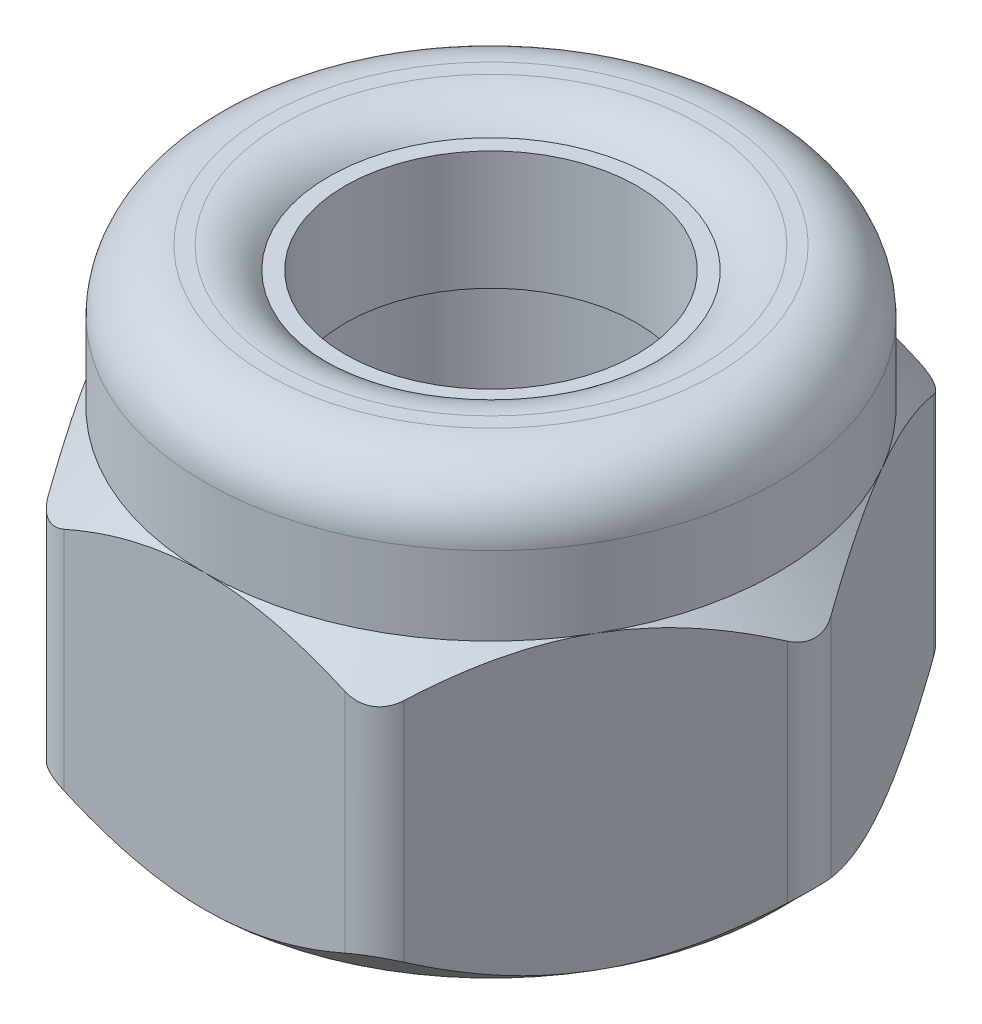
ISO-10303-21;
HEADER;
FILE_DESCRIPTION(('STEP AP214'),'2;1');
FILE_NAME('part.step','',(''),(''),'','','');
FILE_SCHEMA(('AUTOMOTIVE_DESIGN { 1 0 10303 214 1 1 1 1 }'));
ENDSEC;
DATA;
#1=APPLICATION_CONTEXT('core data for automotive mechanical design processes');
#2=APPLICATION_PROTOCOL_DEFINITION('international standard','automotive_design',2000,#1);
#3=PRODUCT_CONTEXT('',#1,'mechanical');
#4=PRODUCT('Part','Part','',(#3));
#5=PRODUCT_RELATED_PRODUCT_CATEGORY('part','',(#4));
#6=PRODUCT_DEFINITION_FORMATION('','',#4);
#7=PRODUCT_DEFINITION_CONTEXT('part definition',#1,'design');
#8=PRODUCT_DEFINITION('design','',#6,#7);
#9=PRODUCT_DEFINITION_SHAPE('','',#8);
#10=(LENGTH_UNIT() NAMED_UNIT(*) SI_UNIT(.MILLI.,.METRE.));
#11=(NAMED_UNIT(*) PLANE_ANGLE_UNIT() SI_UNIT($,.RADIAN.));
#12=(NAMED_UNIT(*) SI_UNIT($,.STERADIAN.) SOLID_ANGLE_UNIT());
#13=UNCERTAINTY_MEASURE_WITH_UNIT(LENGTH_MEASURE(1.E-05),#10,'distance_accuracy_value','');
#14=(GEOMETRIC_REPRESENTATION_CONTEXT(3) GLOBAL_UNCERTAINTY_ASSIGNED_CONTEXT((#13)) GLOBAL_UNIT_ASSIGNED_CONTEXT((#10,
#11,#12)) REPRESENTATION_CONTEXT('',''));
#15=CARTESIAN_POINT('',(0.,0.,0.));
#16=DIRECTION('',(0.,0.,1.));
#17=DIRECTION('',(1.,0.,0.));
#18=AXIS2_PLACEMENT_3D('',#15,#16,#17);
#19=CARTESIAN_POINT('',(0.,-1.35,0.));
#20=DIRECTION('',(0.,1.,0.));
#21=DIRECTION('',(0.,0.,1.));
#22=AXIS2_PLACEMENT_3D('',#19,#20,#21);
#23=PLANE('',#22);
#24=CARTESIAN_POINT('',(0.,-1.35,0.));
#25=DIRECTION('',(0.,1.,0.));
#26=DIRECTION('',(0.,0.,1.));
#27=AXIS2_PLACEMENT_3D('',#24,#25,#26);
#28=CIRCLE('',#27,1.5);
#29=CARTESIAN_POINT('',(0.,-1.35,1.5));
#30=VERTEX_POINT('',#29);
#31=EDGE_CURVE('E212',#30,#30,#28,.T.);
#32=ORIENTED_EDGE('',*,*,#31,.T.);
#33=EDGE_LOOP('',(#32));
#34=FACE_BOUND('',#33,.T.);
#35=CARTESIAN_POINT('',(0.,-1.34999999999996,0.));
#36=DIRECTION('',(0.,-1.,0.));
#37=DIRECTION('',(1.,0.,0.));
#38=AXIS2_PLACEMENT_3D('',#35,#36,#37);
#39=CIRCLE('',#38,2.65);
#40=CARTESIAN_POINT('',(2.29496732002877,-1.34999999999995,1.32500000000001));
#41=VERTEX_POINT('',#40);
#42=CARTESIAN_POINT('',(0.,-1.35,2.65));
#43=VERTEX_POINT('',#42);
#44=EDGE_CURVE('E569',#41,#43,#39,.T.);
#45=ORIENTED_EDGE('',*,*,#44,.T.);
#46=CARTESIAN_POINT('',(0.,-1.35,0.));
#47=DIRECTION('',(0.,1.,0.));
#48=DIRECTION('',(0.,0.,1.));
#49=AXIS2_PLACEMENT_3D('',#46,#47,#48);
#50=CIRCLE('',#49,2.64999999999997);
#51=CARTESIAN_POINT('',(-2.29496732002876,-1.34999999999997,1.32500000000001));
#52=VERTEX_POINT('',#51);
#53=EDGE_CURVE('E355',#52,#43,#50,.T.);
#54=ORIENTED_EDGE('',*,*,#53,.F.);
#55=CARTESIAN_POINT('',(-2.29496732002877,-1.34999999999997,-1.325));
#56=VERTEX_POINT('',#55);
#57=EDGE_CURVE('E439',#56,#52,#50,.T.);
#58=ORIENTED_EDGE('',*,*,#57,.F.);
#59=CARTESIAN_POINT('',(0.,-1.34999999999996,-2.65));
#60=VERTEX_POINT('',#59);
#61=EDGE_CURVE('E557',#60,#56,#50,.T.);
#62=ORIENTED_EDGE('',*,*,#61,.F.);
#63=CARTESIAN_POINT('',(2.29496732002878,-1.34999999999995,-1.325));
#64=VERTEX_POINT('',#63);
#65=EDGE_CURVE('E568',#64,#60,#50,.T.);
#66=ORIENTED_EDGE('',*,*,#65,.F.);
#67=EDGE_CURVE('E440',#41,#64,#50,.T.);
#68=ORIENTED_EDGE('',*,*,#67,.F.);
#69=EDGE_LOOP('',(#45,#54,#58,#62,#66,#68));
#70=FACE_BOUND('',#69,.T.);
#71=ADVANCED_FACE('F46',(#34,#70),#23,.F.);
#72=CARTESIAN_POINT('',(0.,-1.35,0.));
#73=DIRECTION('',(0.,1.,0.));
#74=DIRECTION('',(0.,0.,1.));
#75=AXIS2_PLACEMENT_3D('',#72,#73,#74);
#76=CYLINDRICAL_SURFACE('',#75,1.5);
#77=ORIENTED_EDGE('',*,*,#31,.F.);
#78=EDGE_LOOP('',(#77));
#79=FACE_BOUND('',#78,.T.);
#80=CARTESIAN_POINT('',(0.,1.35,0.));
#81=DIRECTION('',(0.,1.,0.));
#82=DIRECTION('',(0.,0.,1.));
#83=AXIS2_PLACEMENT_3D('',#80,#81,#82);
#84=CIRCLE('',#83,1.5);
#85=CARTESIAN_POINT('',(0.,1.35,1.5));
#86=VERTEX_POINT('',#85);
#87=EDGE_CURVE('E204',#86,#86,#84,.F.);
#88=ORIENTED_EDGE('',*,*,#87,.F.);
#89=EDGE_LOOP('',(#88));
#90=FACE_BOUND('',#89,.T.);
#91=ADVANCED_FACE('F517',(#79,#90),#76,.F.);
#92=CARTESIAN_POINT('',(0.,2.65,0.));
#93=DIRECTION('',(0.,-1.,0.));
#94=DIRECTION('',(0.,0.,-1.));
#95=AXIS2_PLACEMENT_3D('',#92,#93,#94);
#96=CYLINDRICAL_SURFACE('',#95,2.65);
#97=CARTESIAN_POINT('',(0.,2.075,0.));
#98=DIRECTION('',(0.,1.,0.));
#99=DIRECTION('',(0.,0.,1.));
#100=AXIS2_PLACEMENT_3D('',#97,#98,#99);
#101=CIRCLE('',#100,2.65);
#102=CARTESIAN_POINT('',(0.,2.075,2.65));
#103=VERTEX_POINT('',#102);
#104=EDGE_CURVE('E435',#103,#103,#101,.F.);
#105=ORIENTED_EDGE('',*,*,#104,.T.);
#106=EDGE_LOOP('',(#105));
#107=FACE_BOUND('',#106,.T.);
#108=CARTESIAN_POINT('',(0.,1.35,0.));
#109=DIRECTION('',(0.,1.,0.));
#110=DIRECTION('',(0.,0.,1.));
#111=AXIS2_PLACEMENT_3D('',#108,#109,#110);
#112=CIRCLE('',#111,2.65);
#113=CARTESIAN_POINT('',(0.,1.35,2.65));
#114=VERTEX_POINT('',#113);
#115=CARTESIAN_POINT('',(2.29496732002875,1.34999999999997,1.32499999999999));
#116=VERTEX_POINT('',#115);
#117=EDGE_CURVE('E182',#114,#116,#112,.T.);
#118=ORIENTED_EDGE('',*,*,#117,.T.);
#119=CARTESIAN_POINT('',(2.29496732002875,1.34999999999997,-1.325));
#120=VERTEX_POINT('',#119);
#121=EDGE_CURVE('E195',#116,#120,#112,.T.);
#122=ORIENTED_EDGE('',*,*,#121,.T.);
#123=CARTESIAN_POINT('',(0.,1.34999999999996,-2.65));
#124=VERTEX_POINT('',#123);
#125=EDGE_CURVE('E205',#120,#124,#112,.T.);
#126=ORIENTED_EDGE('',*,*,#125,.T.);
#127=CARTESIAN_POINT('',(-2.29496732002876,1.34999999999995,-1.325));
#128=VERTEX_POINT('',#127);
#129=EDGE_CURVE('E885',#124,#128,#112,.T.);
#130=ORIENTED_EDGE('',*,*,#129,.T.);
#131=CARTESIAN_POINT('',(-2.29496732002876,1.34999999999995,1.325));
#132=VERTEX_POINT('',#131);
#133=EDGE_CURVE('E582',#128,#132,#112,.T.);
#134=ORIENTED_EDGE('',*,*,#133,.T.);
#135=EDGE_CURVE('E211',#132,#114,#112,.T.);
#136=ORIENTED_EDGE('',*,*,#135,.T.);
#137=EDGE_LOOP('',(#118,#122,#126,#130,#134,#136));
#138=FACE_BOUND('',#137,.T.);
#139=ADVANCED_FACE('F208',(#107,#138),#96,.T.);
#140=CARTESIAN_POINT('',(0.,2.65,0.));
#141=DIRECTION('',(0.,1.,0.));
#142=DIRECTION('',(0.,0.,1.));
#143=AXIS2_PLACEMENT_3D('',#140,#141,#142);
#144=PLANE('',#143);
#145=CARTESIAN_POINT('',(0.,2.65,0.));
#146=DIRECTION('',(0.,1.,0.));
#147=DIRECTION('',(0.,0.,1.));
#148=AXIS2_PLACEMENT_3D('',#145,#146,#147);
#149=CIRCLE('',#148,1.93588989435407);
#150=CARTESIAN_POINT('',(0.,2.65,1.93588989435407));
#151=VERTEX_POINT('',#150);
#152=EDGE_CURVE('E432',#151,#151,#149,.F.);
#153=ORIENTED_EDGE('',*,*,#152,.T.);
#154=EDGE_LOOP('',(#153));
#155=FACE_BOUND('',#154,.T.);
#156=CARTESIAN_POINT('',(0.,2.65,0.));
#157=DIRECTION('',(0.,1.,0.));
#158=DIRECTION('',(0.,0.,1.));
#159=AXIS2_PLACEMENT_3D('',#156,#157,#158);
#160=CIRCLE('',#159,2.075);
#161=CARTESIAN_POINT('',(0.,2.65,2.075));
#162=VERTEX_POINT('',#161);
#163=EDGE_CURVE('E429',#162,#162,#160,.T.);
#164=ORIENTED_EDGE('',*,*,#163,.T.);
#165=EDGE_LOOP('',(#164));
#166=FACE_BOUND('',#165,.T.);
#167=ADVANCED_FACE('F774',(#155,#166),#144,.T.);
#168=CARTESIAN_POINT('',(0.,2.45,0.));
#169=DIRECTION('',(0.,1.,0.));
#170=DIRECTION('',(0.,0.,1.));
#171=AXIS2_PLACEMENT_3D('',#168,#169,#170);
#172=PLANE('',#171);
#173=CARTESIAN_POINT('',(0.,2.45,0.));
#174=DIRECTION('',(0.,1.,0.));
#175=DIRECTION('',(0.,0.,1.));
#176=AXIS2_PLACEMENT_3D('',#173,#174,#175);
#177=CIRCLE('',#176,1.35);
#178=CARTESIAN_POINT('',(0.,2.45,1.35));
#179=VERTEX_POINT('',#178);
#180=EDGE_CURVE('E416',#179,#179,#177,.T.);
#181=ORIENTED_EDGE('',*,*,#180,.F.);
#182=EDGE_LOOP('',(#181));
#183=FACE_BOUND('',#182,.T.);
#184=CARTESIAN_POINT('',(0.,2.45,0.));
#185=DIRECTION('',(0.,1.,0.));
#186=DIRECTION('',(0.,0.,1.));
#187=AXIS2_PLACEMENT_3D('',#184,#185,#186);
#188=CIRCLE('',#187,1.5);
#189=CARTESIAN_POINT('',(0.,2.45,1.5));
#190=VERTEX_POINT('',#189);
#191=EDGE_CURVE('E419',#190,#190,#188,.T.);
#192=ORIENTED_EDGE('',*,*,#191,.T.);
#193=EDGE_LOOP('',(#192));
#194=FACE_BOUND('',#193,.T.);
#195=ADVANCED_FACE('F764',(#183,#194),#172,.T.);
#196=CARTESIAN_POINT('',(0.,-2.89264068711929,0.));
#197=DIRECTION('',(0.,1.,0.));
#198=DIRECTION('',(0.,0.,1.));
#199=AXIS2_PLACEMENT_3D('',#196,#197,#198);
#200=CYLINDRICAL_SURFACE('',#199,1.35);
#201=CARTESIAN_POINT('',(0.,1.35,0.));
#202=DIRECTION('',(0.,1.,0.));
#203=DIRECTION('',(0.,0.,1.));
#204=AXIS2_PLACEMENT_3D('',#201,#202,#203);
#205=CIRCLE('',#204,1.35);
#206=CARTESIAN_POINT('',(0.,1.35,1.35));
#207=VERTEX_POINT('',#206);
#208=EDGE_CURVE('E422',#207,#207,#205,.F.);
#209=ORIENTED_EDGE('',*,*,#208,.T.);
#210=EDGE_LOOP('',(#209));
#211=FACE_BOUND('',#210,.T.);
#212=ORIENTED_EDGE('',*,*,#180,.T.);
#213=EDGE_LOOP('',(#212));
#214=FACE_BOUND('',#213,.T.);
#215=ADVANCED_FACE('F755',(#211,#214),#200,.F.);
#216=CARTESIAN_POINT('',(0.,1.35,0.));
#217=DIRECTION('',(0.,1.,0.));
#218=DIRECTION('',(0.,0.,1.));
#219=AXIS2_PLACEMENT_3D('',#216,#217,#218);
#220=PLANE('',#219);
#221=ORIENTED_EDGE('',*,*,#87,.T.);
#222=EDGE_LOOP('',(#221));
#223=FACE_BOUND('',#222,.T.);
#224=ORIENTED_EDGE('',*,*,#208,.F.);
#225=EDGE_LOOP('',(#224));
#226=FACE_BOUND('',#225,.T.);
#227=ADVANCED_FACE('F745',(#223,#226),#220,.F.);
#228=CARTESIAN_POINT('',(0.,2.075,0.));
#229=DIRECTION('',(0.,1.,0.));
#230=DIRECTION('',(0.,0.,1.));
#231=AXIS2_PLACEMENT_3D('',#228,#229,#230);
#232=TOROIDAL_SURFACE('',#231,1.93588989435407,0.575);
#233=ORIENTED_EDGE('',*,*,#152,.F.);
#234=EDGE_LOOP('',(#233));
#235=FACE_BOUND('',#234,.T.);
#236=ORIENTED_EDGE('',*,*,#191,.F.);
#237=EDGE_LOOP('',(#236));
#238=FACE_BOUND('',#237,.T.);
#239=ADVANCED_FACE('F735',(#235,#238),#232,.T.);
#240=CARTESIAN_POINT('',(0.,2.075,0.));
#241=DIRECTION('',(0.,1.,0.));
#242=DIRECTION('',(0.,0.,1.));
#243=AXIS2_PLACEMENT_3D('',#240,#241,#242);
#244=TOROIDAL_SURFACE('',#243,2.075,0.575);
#245=ORIENTED_EDGE('',*,*,#104,.F.);
#246=EDGE_LOOP('',(#245));
#247=FACE_BOUND('',#246,.T.);
#248=ORIENTED_EDGE('',*,*,#163,.F.);
#249=EDGE_LOOP('',(#248));
#250=FACE_BOUND('',#249,.T.);
#251=ADVANCED_FACE('F459',(#247,#250),#244,.T.);
#252=CARTESIAN_POINT('',(0.,0.940043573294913,0.));
#253=DIRECTION('',(0.,-1.,0.));
#254=DIRECTION('',(1.,0.,0.));
#255=AXIS2_PLACEMENT_3D('',#252,#253,#254);
#256=CONICAL_SURFACE('',#255,3.05995642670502,0.785398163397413);
#257=CARTESIAN_POINT('',(1.52986274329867,0.939928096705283,2.6502));
#258=CARTESIAN_POINT('',(1.58245580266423,0.992476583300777,2.55910614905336));
#259=CARTESIAN_POINT('',(1.63592828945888,1.0419388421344,2.46648908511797));
#260=CARTESIAN_POINT('',(1.74496458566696,1.13250309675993,2.27763268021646));
#261=CARTESIAN_POINT('',(1.80053876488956,1.17355470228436,2.18137537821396));
#262=CARTESIAN_POINT('',(1.91260144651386,1.24387692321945,1.98727712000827));
#263=CARTESIAN_POINT('',(1.96906140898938,1.27332429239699,1.88948559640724));
#264=CARTESIAN_POINT('',(2.08322429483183,1.31869408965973,1.69174967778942));
#265=CARTESIAN_POINT('',(2.14092373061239,1.33465038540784,1.59181132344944));
#266=CARTESIAN_POINT('',(2.24036562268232,1.3490470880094,1.41957291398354));
#267=CARTESIAN_POINT('',(2.28197960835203,1.35117827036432,1.34749537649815));
#268=CARTESIAN_POINT('',(2.36513955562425,1.34758788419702,1.20345812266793));
#269=CARTESIAN_POINT('',(2.40668548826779,1.34186356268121,1.13149845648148));
#270=CARTESIAN_POINT('',(2.48938506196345,1.32288791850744,0.988258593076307));
#271=CARTESIAN_POINT('',(2.53053821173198,1.30962817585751,0.916979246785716));
#272=CARTESIAN_POINT('',(2.61213287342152,1.27630954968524,0.775653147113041));
#273=CARTESIAN_POINT('',(2.65257443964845,1.25625118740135,0.705606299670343));
#274=CARTESIAN_POINT('',(2.75616125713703,1.19670435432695,0.526188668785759));
#275=CARTESIAN_POINT('',(2.8186642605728,1.152727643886,0.417930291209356));
#276=CARTESIAN_POINT('',(2.91056948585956,1.07848905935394,0.258745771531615));
#277=CARTESIAN_POINT('',(2.94085636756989,1.05240505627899,0.206287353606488));
#278=CARTESIAN_POINT('',(3.00086912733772,0.997859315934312,0.102342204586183));
#279=CARTESIAN_POINT('',(3.03059533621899,0.969399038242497,0.0508549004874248));
#280=CARTESIAN_POINT('',(3.06007189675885,0.939928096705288,-0.00020000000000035));
#281=B_SPLINE_CURVE_WITH_KNOTS('',3,(#257,#258,#259,#260,#261,#262,#263,#264,#265,#266,#267,
#268,#269,#270,#271,#272,#273,#274,#275,#276,#277,#278,#279,#280),.UNSPECIFIED.,.F.,.F.,(4,2,2,
2,2,2,2,2,2,2,2,4),(0.,0.352989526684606,0.70803574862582,1.05744302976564,1.40597054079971,
1.65538279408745,1.90488247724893,2.15466149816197,2.40442137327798,2.80113631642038,
2.99895589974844,3.19665485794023),.UNSPECIFIED.);
#282=CARTESIAN_POINT('',(2.9444863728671,1.04872908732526,0.19999999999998));
#283=VERTEX_POINT('',#282);
#284=EDGE_CURVE('E190',#116,#283,#281,.T.);
#285=ORIENTED_EDGE('',*,*,#284,.T.);
#286=CARTESIAN_POINT('',(2.94448637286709,1.0487290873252,0.2));
#287=CARTESIAN_POINT('',(2.95297162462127,1.04125968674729,0.185337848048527));
#288=CARTESIAN_POINT('',(2.96067507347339,1.03450628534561,0.169807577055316));
#289=CARTESIAN_POINT('',(2.9741994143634,1.02268083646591,0.137258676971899));
#290=CARTESIAN_POINT('',(2.98001105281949,1.01761705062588,0.120233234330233));
#291=CARTESIAN_POINT('',(2.98936506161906,1.00947944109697,0.0850108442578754));
#292=CARTESIAN_POINT('',(2.99289715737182,1.00641462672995,0.066808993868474));
#293=CARTESIAN_POINT('',(2.99738734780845,1.00252013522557,0.0299083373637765));
#294=CARTESIAN_POINT('',(2.99835345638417,1.00168349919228,0.0112112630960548));
#295=CARTESIAN_POINT('',(2.99768476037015,1.00226304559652,-0.0247889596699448));
#296=CARTESIAN_POINT('',(2.99622673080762,1.00352611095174,-0.0420983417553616));
#297=CARTESIAN_POINT('',(2.99113271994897,1.00794613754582,-0.0761870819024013));
#298=CARTESIAN_POINT('',(2.98749120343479,1.01110791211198,-0.092964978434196));
#299=CARTESIAN_POINT('',(2.9782314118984,1.01916780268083,-0.125579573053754));
#300=CARTESIAN_POINT('',(2.97260622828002,1.02407198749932,-0.141412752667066));
#301=CARTESIAN_POINT('',(2.95970637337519,1.03535556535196,-0.171745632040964));
#302=CARTESIAN_POINT('',(2.95243910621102,1.04172833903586,-0.186250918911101));
#303=CARTESIAN_POINT('',(2.94448637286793,1.04872908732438,-0.200000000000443));
#304=B_SPLINE_CURVE_WITH_KNOTS('',3,(#286,#287,#288,#289,#290,#291,#292,#293,#294,#295,#296,
#297,#298,#299,#300,#301,#302,#303),.UNSPECIFIED.,.F.,.F.,(4,2,2,2,2,2,2,2,4),(0.,
0.0555553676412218,0.111378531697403,0.167451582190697,0.223349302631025,0.275346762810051,
0.327476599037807,0.379789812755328,0.431871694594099),.UNSPECIFIED.);
#305=CARTESIAN_POINT('',(2.94448637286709,1.0487290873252,-0.2));
#306=VERTEX_POINT('',#305);
#307=EDGE_CURVE('E312',#283,#306,#304,.T.);
#308=ORIENTED_EDGE('',*,*,#307,.T.);
#309=CARTESIAN_POINT('',(3.06007189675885,0.939928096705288,0.000200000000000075));
#310=CARTESIAN_POINT('',(3.00747883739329,0.992476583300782,-0.090893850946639));
#311=CARTESIAN_POINT('',(2.95400635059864,1.0419388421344,-0.183510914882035));
#312=CARTESIAN_POINT('',(2.84497005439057,1.13250309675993,-0.372367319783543));
#313=CARTESIAN_POINT('',(2.78939587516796,1.17355470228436,-0.468624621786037));
#314=CARTESIAN_POINT('',(2.67733319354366,1.24387692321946,-0.662722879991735));
#315=CARTESIAN_POINT('',(2.62087323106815,1.273324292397,-0.760514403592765));
#316=CARTESIAN_POINT('',(2.50671034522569,1.31869408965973,-0.958250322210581));
#317=CARTESIAN_POINT('',(2.44901090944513,1.33465038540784,-1.05818867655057));
#318=CARTESIAN_POINT('',(2.3495690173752,1.3490470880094,-1.23042708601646));
#319=CARTESIAN_POINT('',(2.30795503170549,1.35117827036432,-1.30250462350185));
#320=CARTESIAN_POINT('',(2.22479508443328,1.34758788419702,-1.44654187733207));
#321=CARTESIAN_POINT('',(2.18324915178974,1.34186356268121,-1.51850154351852));
#322=CARTESIAN_POINT('',(2.10054957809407,1.32288791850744,-1.66174140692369));
#323=CARTESIAN_POINT('',(2.05939642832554,1.30962817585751,-1.73302075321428));
#324=CARTESIAN_POINT('',(1.977801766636,1.27630954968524,-1.87434685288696));
#325=CARTESIAN_POINT('',(1.93736020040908,1.25625118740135,-1.94439370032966));
#326=CARTESIAN_POINT('',(1.8337733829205,1.19670435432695,-2.12381133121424));
#327=CARTESIAN_POINT('',(1.77127037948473,1.152727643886,-2.23206970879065));
#328=CARTESIAN_POINT('',(1.67936515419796,1.07848905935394,-2.39125422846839));
#329=CARTESIAN_POINT('',(1.64907827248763,1.05240505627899,-2.44371264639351));
#330=CARTESIAN_POINT('',(1.5890655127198,0.997859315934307,-2.54765779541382));
#331=CARTESIAN_POINT('',(1.55933930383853,0.969399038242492,-2.59914509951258));
#332=CARTESIAN_POINT('',(1.52986274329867,0.939928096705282,-2.6502));
#333=B_SPLINE_CURVE_WITH_KNOTS('',3,(#309,#310,#311,#312,#313,#314,#315,#316,#317,#318,#319,
#320,#321,#322,#323,#324,#325,#326,#327,#328,#329,#330,#331,#332),.UNSPECIFIED.,.F.,.F.,(4,2,2,
2,2,2,2,2,2,2,2,4),(0.,0.352989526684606,0.70803574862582,1.05744302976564,1.40597054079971,
1.65538279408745,1.90488247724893,2.15466149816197,2.40442137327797,2.80113631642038,
2.99895589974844,3.19665485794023),.UNSPECIFIED.);
#334=EDGE_CURVE('E199',#306,#120,#333,.T.);
#335=ORIENTED_EDGE('',*,*,#334,.T.);
#336=ORIENTED_EDGE('',*,*,#121,.F.);
#337=EDGE_LOOP('',(#285,#308,#335,#336));
#338=FACE_BOUND('',#337,.T.);
#339=ADVANCED_FACE('F196',(#338),#256,.T.);
#340=CARTESIAN_POINT('',(-3.19293845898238,-0.149380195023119,2.65));
#341=CARTESIAN_POINT('',(-3.11579856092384,-0.0900345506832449,2.65));
#342=CARTESIAN_POINT('',(-3.03824301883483,-0.031220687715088,2.65));
#343=CARTESIAN_POINT('',(-2.88213075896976,0.0851005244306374,2.65));
#344=CARTESIAN_POINT('',(-2.8035738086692,0.14260756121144,2.65));
#345=CARTESIAN_POINT('',(-2.64471477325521,0.256481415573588,2.65));
#346=CARTESIAN_POINT('',(-2.56440390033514,0.312836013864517,2.65));
#347=CARTESIAN_POINT('',(-2.40244554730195,0.423584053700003,2.65));
#348=CARTESIAN_POINT('',(-2.32079815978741,0.477977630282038,2.65));
#349=CARTESIAN_POINT('',(-2.15070211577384,0.587738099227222,2.65));
#350=CARTESIAN_POINT('',(-2.062151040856,0.642947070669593,2.65));
#351=CARTESIAN_POINT('',(-1.88299579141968,0.749921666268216,2.65));
#352=CARTESIAN_POINT('',(-1.79239188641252,0.801687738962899,2.65));
#353=CARTESIAN_POINT('',(-1.6090671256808,0.900699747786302,2.65));
#354=CARTESIAN_POINT('',(-1.51635315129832,0.947958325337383,2.65));
#355=CARTESIAN_POINT('',(-1.32830426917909,1.03688782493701,2.65));
#356=CARTESIAN_POINT('',(-1.23297062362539,1.07856138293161,2.65));
#357=CARTESIAN_POINT('',(-1.04902167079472,1.15104776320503,2.65));
#358=CARTESIAN_POINT('',(-0.960671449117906,1.18252645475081,2.65));
#359=CARTESIAN_POINT('',(-0.781720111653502,1.23841194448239,2.65));
#360=CARTESIAN_POINT('',(-0.691118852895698,1.26281829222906,2.65));
#361=CARTESIAN_POINT('',(-0.509784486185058,1.30283119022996,2.65));
#362=CARTESIAN_POINT('',(-0.419087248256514,1.31859756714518,2.65));
#363=CARTESIAN_POINT('',(-0.236565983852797,1.34100159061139,2.65));
#364=CARTESIAN_POINT('',(-0.14474219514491,1.34764113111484,2.65));
#365=CARTESIAN_POINT('',(0.0350798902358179,1.35122597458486,2.65));
#366=CARTESIAN_POINT('',(0.123070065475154,1.34858210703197,2.65));
#367=CARTESIAN_POINT('',(0.298363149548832,1.3346890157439,2.65));
#368=CARTESIAN_POINT('',(0.385665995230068,1.32343901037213,2.65));
#369=CARTESIAN_POINT('',(0.560435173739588,1.29277935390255,2.65));
#370=CARTESIAN_POINT('',(0.647875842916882,1.27322564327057,2.65));
#371=CARTESIAN_POINT('',(0.820822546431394,1.2270402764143,2.65));
#372=CARTESIAN_POINT('',(0.906328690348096,1.20040902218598,2.65));
#373=CARTESIAN_POINT('',(1.16947098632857,1.10827545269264,2.65));
#374=CARTESIAN_POINT('',(1.34353525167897,1.03253918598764,2.65));
#375=CARTESIAN_POINT('',(1.59828908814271,0.90620022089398,2.65));
#376=CARTESIAN_POINT('',(1.68230603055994,0.861866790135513,2.65));
#377=CARTESIAN_POINT('',(1.84843827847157,0.769761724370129,2.65));
#378=CARTESIAN_POINT('',(1.93055391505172,0.721990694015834,2.65));
#379=CARTESIAN_POINT('',(2.08909182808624,0.626126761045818,2.65));
#380=CARTESIAN_POINT('',(2.16559503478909,0.578166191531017,2.65));
#381=CARTESIAN_POINT('',(2.31728875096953,0.480202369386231,2.65));
#382=CARTESIAN_POINT('',(2.39247916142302,0.43019896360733,2.65));
#383=CARTESIAN_POINT('',(2.54111260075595,0.328922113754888,2.65));
#384=CARTESIAN_POINT('',(2.61456481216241,0.277662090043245,2.65));
#385=CARTESIAN_POINT('',(2.760461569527,0.173767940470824,2.65));
#386=CARTESIAN_POINT('',(2.83290638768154,0.121134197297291,2.65));
#387=CARTESIAN_POINT('',(2.90492883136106,0.0679380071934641,2.65));
#388=B_SPLINE_CURVE_WITH_KNOTS('',3,(#340,#341,#342,#343,#344,#345,#346,#347,#348,#349,#350,
#351,#352,#353,#354,#355,#356,#357,#358,#359,#360,#361,#362,#363,#364,#365,#366,#367,#368,#369,
#370,#371,#372,#373,#374,#375,#376,#377,#378,#379,#380,#381,#382,#383,#384,#385,#386,#387),
.UNSPECIFIED.,.F.,.F.,(4,2,2,2,2,2,2,2,2,2,2,2,2,2,2,2,2,2,2,2,2,2,2,4),(0.,0.291985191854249,
0.584039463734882,0.878346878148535,1.17263398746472,1.48562805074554,1.79858125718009,
2.11062924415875,2.42252943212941,2.70365861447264,2.98480569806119,3.26055948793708,
3.53625604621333,3.79990857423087,4.06358505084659,4.33203596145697,4.60047162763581,
5.1681952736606,5.45315995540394,5.73807463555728,6.00892277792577,6.27979126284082,
6.54848497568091,6.81710461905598),.UNSPECIFIED.);
#389=CARTESIAN_POINT('',(1.29903810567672,1.0487290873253,2.65));
#390=VERTEX_POINT('',#389);
#391=EDGE_CURVE('E249',#114,#390,#388,.T.);
#392=ORIENTED_EDGE('',*,*,#391,.T.);
#393=CARTESIAN_POINT('',(1.29903810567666,1.0487290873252,2.65));
#394=CARTESIAN_POINT('',(1.31597852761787,1.04125968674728,2.65001736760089));
#395=CARTESIAN_POINT('',(1.33327986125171,1.03450628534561,2.64892361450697));
#396=CARTESIAN_POINT('',(1.36823020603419,1.02268083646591,2.64436158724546));
#397=CARTESIAN_POINT('',(1.38588049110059,1.01761705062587,2.64088189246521));
#398=CARTESIAN_POINT('',(1.42106098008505,1.00947944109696,2.63137150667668));
#399=CARTESIAN_POINT('',(1.43859029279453,1.00641462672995,2.62532946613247));
#400=CARTESIAN_POINT('',(1.47279229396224,1.00252013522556,2.61076775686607));
#401=CARTESIAN_POINT('',(1.48946748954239,1.00168349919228,2.6022558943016));
#402=CARTESIAN_POINT('',(1.52031024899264,1.00226304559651,2.58367667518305));
#403=CARTESIAN_POINT('',(1.53457159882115,1.00352611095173,2.57375929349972));
#404=CARTESIAN_POINT('',(1.56154630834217,1.00794613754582,2.55230338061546));
#405=CARTESIAN_POINT('',(1.57425563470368,1.01110791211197,2.54076078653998));
#406=CARTESIAN_POINT('',(1.59787080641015,1.01916780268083,2.51643427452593));
#407=CARTESIAN_POINT('',(1.60877015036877,1.02407198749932,2.50364613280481));
#408=CARTESIAN_POINT('',(1.62858926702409,1.03535556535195,2.47730809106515));
#409=CARTESIAN_POINT('',(1.63751758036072,1.04172833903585,2.46376180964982));
#410=CARTESIAN_POINT('',(1.64544826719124,1.04872908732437,2.45000000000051));
#411=B_SPLINE_CURVE_WITH_KNOTS('',3,(#393,#394,#395,#396,#397,#398,#399,#400,#401,#402,#403,
#404,#405,#406,#407,#408,#409,#410),.UNSPECIFIED.,.F.,.F.,(4,2,2,2,2,2,2,2,4),(0.,
0.0555553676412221,0.111378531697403,0.167451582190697,0.223349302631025,0.275346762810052,
0.327476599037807,0.379789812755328,0.431871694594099),.UNSPECIFIED.);
#412=CARTESIAN_POINT('',(1.64544826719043,1.0487290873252,2.45));
#413=VERTEX_POINT('',#412);
#414=EDGE_CURVE('E184',#390,#413,#411,.T.);
#415=ORIENTED_EDGE('',*,*,#414,.T.);
#416=EDGE_CURVE('E178',#413,#116,#281,.T.);
#417=ORIENTED_EDGE('',*,*,#416,.T.);
#418=ORIENTED_EDGE('',*,*,#117,.F.);
#419=EDGE_LOOP('',(#392,#415,#417,#418));
#420=FACE_BOUND('',#419,.T.);
#421=ADVANCED_FACE('F180',(#420),#256,.T.);
#422=CARTESIAN_POINT('',(-3.06007189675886,0.939928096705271,-0.000200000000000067));
#423=CARTESIAN_POINT('',(-3.0074788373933,0.992476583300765,0.0908938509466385));
#424=CARTESIAN_POINT('',(-2.95400635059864,1.04193884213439,0.183510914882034));
#425=CARTESIAN_POINT('',(-2.84497005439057,1.13250309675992,0.372367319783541));
#426=CARTESIAN_POINT('',(-2.78939587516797,1.17355470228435,0.468624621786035));
#427=CARTESIAN_POINT('',(-2.67733319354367,1.24387692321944,0.662722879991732));
#428=CARTESIAN_POINT('',(-2.62087323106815,1.27332429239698,0.760514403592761));
#429=CARTESIAN_POINT('',(-2.5067103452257,1.31869408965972,0.958250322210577));
#430=CARTESIAN_POINT('',(-2.44901090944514,1.33465038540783,1.05818867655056));
#431=CARTESIAN_POINT('',(-2.34956901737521,1.34904708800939,1.23042708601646));
#432=CARTESIAN_POINT('',(-2.3079550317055,1.35117827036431,1.30250462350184));
#433=CARTESIAN_POINT('',(-2.22479508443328,1.34758788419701,1.44654187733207));
#434=CARTESIAN_POINT('',(-2.18324915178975,1.3418635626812,1.51850154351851));
#435=CARTESIAN_POINT('',(-2.10054957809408,1.32288791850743,1.66174140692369));
#436=CARTESIAN_POINT('',(-2.05939642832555,1.3096281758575,1.73302075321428));
#437=CARTESIAN_POINT('',(-1.97780176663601,1.27630954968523,1.87434685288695));
#438=CARTESIAN_POINT('',(-1.93736020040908,1.25625118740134,1.94439370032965));
#439=CARTESIAN_POINT('',(-1.8337733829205,1.19670435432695,2.12381133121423));
#440=CARTESIAN_POINT('',(-1.77127037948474,1.15272764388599,2.23206970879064));
#441=CARTESIAN_POINT('',(-1.67936515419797,1.07848905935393,2.39125422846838));
#442=CARTESIAN_POINT('',(-1.64907827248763,1.05240505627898,2.44371264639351));
#443=CARTESIAN_POINT('',(-1.5890655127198,0.9978593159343,2.54765779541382));
#444=CARTESIAN_POINT('',(-1.55933930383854,0.969399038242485,2.59914509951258));
#445=CARTESIAN_POINT('',(-1.52986274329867,0.939928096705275,2.6502));
#446=B_SPLINE_CURVE_WITH_KNOTS('',3,(#422,#423,#424,#425,#426,#427,#428,#429,#430,#431,#432,
#433,#434,#435,#436,#437,#438,#439,#440,#441,#442,#443,#444,#445),.UNSPECIFIED.,.F.,.F.,(4,2,2,
2,2,2,2,2,2,2,2,4),(0.,0.352989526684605,0.708035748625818,1.05744302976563,1.40597054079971,
1.65538279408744,1.90488247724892,2.15466149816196,2.40442137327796,2.80113631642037,
2.99895589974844,3.19665485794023),.UNSPECIFIED.);
#447=CARTESIAN_POINT('',(-1.64544826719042,1.04872908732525,2.45000000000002));
#448=VERTEX_POINT('',#447);
#449=EDGE_CURVE('E258',#132,#448,#446,.T.);
#450=ORIENTED_EDGE('',*,*,#449,.T.);
#451=CARTESIAN_POINT('',(-1.64544826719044,1.04872908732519,2.45));
#452=CARTESIAN_POINT('',(-1.6369930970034,1.04125968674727,2.46467951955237));
#453=CARTESIAN_POINT('',(-1.62739521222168,1.0345062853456,2.47911603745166));
#454=CARTESIAN_POINT('',(-1.60596920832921,1.0226808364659,2.50710291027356));
#455=CARTESIAN_POINT('',(-1.5941305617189,1.01761705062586,2.52064865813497));
#456=CARTESIAN_POINT('',(-1.56830408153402,1.00947944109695,2.54636066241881));
#457=CARTESIAN_POINT('',(-1.55430686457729,1.00641462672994,2.55852047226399));
#458=CARTESIAN_POINT('',(-1.52459505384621,1.00252013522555,2.5808594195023));
#459=CARTESIAN_POINT('',(-1.50888596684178,1.00168349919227,2.59104463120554));
#460=CARTESIAN_POINT('',(-1.47737451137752,1.00226304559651,2.60846563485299));
#461=CARTESIAN_POINT('',(-1.46165513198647,1.00352611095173,2.61585763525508));
#462=CARTESIAN_POINT('',(-1.4295864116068,1.00794613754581,2.62849046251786));
#463=CARTESIAN_POINT('',(-1.41323556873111,1.01110791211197,2.63372576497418));
#464=CARTESIAN_POINT('',(-1.38036060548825,1.01916780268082,2.64201384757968));
#465=CARTESIAN_POINT('',(-1.36383607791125,1.02407198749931,2.64505888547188));
#466=CARTESIAN_POINT('',(-1.33111710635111,1.03535556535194,2.64905372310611));
#467=CARTESIAN_POINT('',(-1.31492152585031,1.04172833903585,2.65001272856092));
#468=CARTESIAN_POINT('',(-1.2990381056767,1.04872908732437,2.65000000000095));
#469=B_SPLINE_CURVE_WITH_KNOTS('',3,(#451,#452,#453,#454,#455,#456,#457,#458,#459,#460,#461,
#462,#463,#464,#465,#466,#467,#468),.UNSPECIFIED.,.F.,.F.,(4,2,2,2,2,2,2,2,4),(0.,
0.0555553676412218,0.111378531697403,0.167451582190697,0.223349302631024,0.27534676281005,
0.327476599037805,0.379789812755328,0.431871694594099),.UNSPECIFIED.);
#470=CARTESIAN_POINT('',(-1.29903810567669,1.04872908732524,2.65));
#471=VERTEX_POINT('',#470);
#472=EDGE_CURVE('E11',#448,#471,#469,.T.);
#473=ORIENTED_EDGE('',*,*,#472,.T.);
#474=EDGE_CURVE('E348',#471,#114,#388,.T.);
#475=ORIENTED_EDGE('',*,*,#474,.T.);
#476=ORIENTED_EDGE('',*,*,#135,.F.);
#477=EDGE_LOOP('',(#450,#473,#475,#476));
#478=FACE_BOUND('',#477,.T.);
#479=ADVANCED_FACE('F242',(#478),#256,.T.);
#480=CARTESIAN_POINT('',(-1.52986274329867,0.939928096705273,-2.6502));
#481=CARTESIAN_POINT('',(-1.58245580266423,0.992476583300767,-2.55910614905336));
#482=CARTESIAN_POINT('',(-1.63592828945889,1.04193884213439,-2.46648908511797));
#483=CARTESIAN_POINT('',(-1.74496458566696,1.13250309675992,-2.27763268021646));
#484=CARTESIAN_POINT('',(-1.80053876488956,1.17355470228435,-2.18137537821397));
#485=CARTESIAN_POINT('',(-1.91260144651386,1.24387692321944,-1.98727712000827));
#486=CARTESIAN_POINT('',(-1.96906140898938,1.27332429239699,-1.88948559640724));
#487=CARTESIAN_POINT('',(-2.08322429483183,1.31869408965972,-1.69174967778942));
#488=CARTESIAN_POINT('',(-2.14092373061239,1.33465038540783,-1.59181132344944));
#489=CARTESIAN_POINT('',(-2.24036562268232,1.34904708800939,-1.41957291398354));
#490=CARTESIAN_POINT('',(-2.28197960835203,1.35117827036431,-1.34749537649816));
#491=CARTESIAN_POINT('',(-2.36513955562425,1.34758788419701,-1.20345812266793));
#492=CARTESIAN_POINT('',(-2.40668548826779,1.3418635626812,-1.13149845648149));
#493=CARTESIAN_POINT('',(-2.48938506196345,1.32288791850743,-0.988258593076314));
#494=CARTESIAN_POINT('',(-2.53053821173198,1.3096281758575,-0.916979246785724));
#495=CARTESIAN_POINT('',(-2.61213287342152,1.27630954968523,-0.77565314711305));
#496=CARTESIAN_POINT('',(-2.65257443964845,1.25625118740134,-0.705606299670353));
#497=CARTESIAN_POINT('',(-2.75616125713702,1.19670435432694,-0.526188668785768));
#498=CARTESIAN_POINT('',(-2.81866426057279,1.15272764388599,-0.417930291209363));
#499=CARTESIAN_POINT('',(-2.91056948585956,1.07848905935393,-0.258745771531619));
#500=CARTESIAN_POINT('',(-2.9408563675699,1.05240505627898,-0.206287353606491));
#501=CARTESIAN_POINT('',(-3.00086912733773,0.997859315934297,-0.102342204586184));
#502=CARTESIAN_POINT('',(-3.03059533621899,0.969399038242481,-0.0508549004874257));
#503=CARTESIAN_POINT('',(-3.06007189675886,0.939928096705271,0.000200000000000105));
#504=B_SPLINE_CURVE_WITH_KNOTS('',3,(#480,#481,#482,#483,#484,#485,#486,#487,#488,#489,#490,
#491,#492,#493,#494,#495,#496,#497,#498,#499,#500,#501,#502,#503),.UNSPECIFIED.,.F.,.F.,(4,2,2,
2,2,2,2,2,2,2,2,4),(0.,0.352989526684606,0.70803574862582,1.05744302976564,1.40597054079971,
1.65538279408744,1.90488247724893,2.15466149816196,2.40442137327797,2.80113631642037,
2.99895589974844,3.19665485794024),.UNSPECIFIED.);
#505=CARTESIAN_POINT('',(-2.94448637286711,1.04872908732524,-0.19999999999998));
#506=VERTEX_POINT('',#505);
#507=EDGE_CURVE('E266',#128,#506,#504,.T.);
#508=ORIENTED_EDGE('',*,*,#507,.T.);
#509=CARTESIAN_POINT('',(-2.94448637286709,1.04872908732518,-0.2));
#510=CARTESIAN_POINT('',(-2.95297162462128,1.04125968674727,-0.185337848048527));
#511=CARTESIAN_POINT('',(-2.96067507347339,1.0345062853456,-0.169807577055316));
#512=CARTESIAN_POINT('',(-2.9741994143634,1.0226808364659,-0.137258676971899));
#513=CARTESIAN_POINT('',(-2.98001105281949,1.01761705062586,-0.120233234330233));
#514=CARTESIAN_POINT('',(-2.98936506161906,1.00947944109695,-0.0850108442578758));
#515=CARTESIAN_POINT('',(-2.99289715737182,1.00641462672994,-0.0668089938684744));
#516=CARTESIAN_POINT('',(-2.99738734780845,1.00252013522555,-0.0299083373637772));
#517=CARTESIAN_POINT('',(-2.99835345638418,1.00168349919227,-0.0112112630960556));
#518=CARTESIAN_POINT('',(-2.99768476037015,1.0022630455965,0.0247889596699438));
#519=CARTESIAN_POINT('',(-2.99622673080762,1.00352611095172,0.0420983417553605));
#520=CARTESIAN_POINT('',(-2.99113271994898,1.00794613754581,0.0761870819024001));
#521=CARTESIAN_POINT('',(-2.9874912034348,1.01110791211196,0.0929649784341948));
#522=CARTESIAN_POINT('',(-2.9782314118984,1.01916780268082,0.125579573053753));
#523=CARTESIAN_POINT('',(-2.97260622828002,1.02407198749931,0.141412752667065));
#524=CARTESIAN_POINT('',(-2.9597063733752,1.03535556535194,0.171745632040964));
#525=CARTESIAN_POINT('',(-2.95243910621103,1.04172833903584,0.1862509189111));
#526=CARTESIAN_POINT('',(-2.94448637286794,1.04872908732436,0.200000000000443));
#527=B_SPLINE_CURVE_WITH_KNOTS('',3,(#509,#510,#511,#512,#513,#514,#515,#516,#517,#518,#519,
#520,#521,#522,#523,#524,#525,#526),.UNSPECIFIED.,.F.,.F.,(4,2,2,2,2,2,2,2,4),(0.,
0.0555553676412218,0.111378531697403,0.167451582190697,0.223349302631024,0.27534676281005,
0.327476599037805,0.379789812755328,0.431871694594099),.UNSPECIFIED.);
#528=CARTESIAN_POINT('',(-2.94448637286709,1.04872908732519,0.2));
#529=VERTEX_POINT('',#528);
#530=EDGE_CURVE('E283',#506,#529,#527,.T.);
#531=ORIENTED_EDGE('',*,*,#530,.T.);
#532=EDGE_CURVE('E573',#529,#132,#446,.T.);
#533=ORIENTED_EDGE('',*,*,#532,.T.);
#534=ORIENTED_EDGE('',*,*,#133,.F.);
#535=EDGE_LOOP('',(#508,#531,#533,#534));
#536=FACE_BOUND('',#535,.T.);
#537=ADVANCED_FACE('F581',(#536),#256,.T.);
#538=CARTESIAN_POINT('',(-3.19293845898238,-0.149380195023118,-2.65));
#539=CARTESIAN_POINT('',(-3.11579856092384,-0.0900345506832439,-2.65));
#540=CARTESIAN_POINT('',(-3.03824301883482,-0.031220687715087,-2.65));
#541=CARTESIAN_POINT('',(-2.88213075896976,0.0851005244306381,-2.65));
#542=CARTESIAN_POINT('',(-2.80357380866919,0.142607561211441,-2.65));
#543=CARTESIAN_POINT('',(-2.6447147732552,0.256481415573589,-2.65));
#544=CARTESIAN_POINT('',(-2.56440390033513,0.312836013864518,-2.65));
#545=CARTESIAN_POINT('',(-2.40244554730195,0.423584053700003,-2.65));
#546=CARTESIAN_POINT('',(-2.32079815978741,0.477977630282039,-2.65));
#547=CARTESIAN_POINT('',(-2.15070211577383,0.587738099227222,-2.65));
#548=CARTESIAN_POINT('',(-2.06215104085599,0.642947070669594,-2.65));
#549=CARTESIAN_POINT('',(-1.88299579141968,0.749921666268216,-2.65));
#550=CARTESIAN_POINT('',(-1.79239188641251,0.801687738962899,-2.65));
#551=CARTESIAN_POINT('',(-1.60906712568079,0.900699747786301,-2.65));
#552=CARTESIAN_POINT('',(-1.51635315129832,0.947958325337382,-2.65));
#553=CARTESIAN_POINT('',(-1.32830426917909,1.03688782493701,-2.65));
#554=CARTESIAN_POINT('',(-1.23297062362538,1.07856138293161,-2.65));
#555=CARTESIAN_POINT('',(-1.04902167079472,1.15104776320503,-2.65));
#556=CARTESIAN_POINT('',(-0.960671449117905,1.18252645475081,-2.65));
#557=CARTESIAN_POINT('',(-0.781720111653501,1.23841194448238,-2.65));
#558=CARTESIAN_POINT('',(-0.691118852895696,1.26281829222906,-2.65));
#559=CARTESIAN_POINT('',(-0.509784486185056,1.30283119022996,-2.65));
#560=CARTESIAN_POINT('',(-0.419087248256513,1.31859756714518,-2.65));
#561=CARTESIAN_POINT('',(-0.236565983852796,1.34100159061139,-2.65));
#562=CARTESIAN_POINT('',(-0.144742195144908,1.34764113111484,-2.65));
#563=CARTESIAN_POINT('',(0.0350798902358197,1.35122597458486,-2.65));
#564=CARTESIAN_POINT('',(0.123070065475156,1.34858210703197,-2.65));
#565=CARTESIAN_POINT('',(0.298363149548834,1.3346890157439,-2.65));
#566=CARTESIAN_POINT('',(0.385665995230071,1.32343901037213,-2.65));
#567=CARTESIAN_POINT('',(0.560435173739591,1.29277935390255,-2.65));
#568=CARTESIAN_POINT('',(0.647875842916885,1.27322564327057,-2.65));
#569=CARTESIAN_POINT('',(0.820822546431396,1.22704027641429,-2.65));
#570=CARTESIAN_POINT('',(0.906328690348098,1.20040902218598,-2.65));
#571=CARTESIAN_POINT('',(1.16947098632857,1.10827545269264,-2.65));
#572=CARTESIAN_POINT('',(1.34353525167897,1.03253918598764,-2.65));
#573=CARTESIAN_POINT('',(1.59828908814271,0.906200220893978,-2.65));
#574=CARTESIAN_POINT('',(1.68230603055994,0.861866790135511,-2.65));
#575=CARTESIAN_POINT('',(1.84843827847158,0.769761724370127,-2.65));
#576=CARTESIAN_POINT('',(1.93055391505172,0.721990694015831,-2.65));
#577=CARTESIAN_POINT('',(2.08909182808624,0.626126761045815,-2.65));
#578=CARTESIAN_POINT('',(2.1655950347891,0.578166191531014,-2.65));
#579=CARTESIAN_POINT('',(2.31728875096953,0.480202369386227,-2.65));
#580=CARTESIAN_POINT('',(2.39247916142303,0.430198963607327,-2.65));
#581=CARTESIAN_POINT('',(2.54111260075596,0.328922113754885,-2.65));
#582=CARTESIAN_POINT('',(2.61456481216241,0.277662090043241,-2.65));
#583=CARTESIAN_POINT('',(2.760461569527,0.17376794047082,-2.65));
#584=CARTESIAN_POINT('',(2.83290638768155,0.121134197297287,-2.65));
#585=CARTESIAN_POINT('',(2.90492883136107,0.0679380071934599,-2.65));
#586=B_SPLINE_CURVE_WITH_KNOTS('',3,(#538,#539,#540,#541,#542,#543,#544,#545,#546,#547,#548,
#549,#550,#551,#552,#553,#554,#555,#556,#557,#558,#559,#560,#561,#562,#563,#564,#565,#566,#567,
#568,#569,#570,#571,#572,#573,#574,#575,#576,#577,#578,#579,#580,#581,#582,#583,#584,#585),
.UNSPECIFIED.,.F.,.F.,(4,2,2,2,2,2,2,2,2,2,2,2,2,2,2,2,2,2,2,2,2,2,2,4),(0.,0.29198519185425,
0.584039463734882,0.878346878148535,1.17263398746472,1.48562805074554,1.79858125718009,
2.11062924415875,2.42252943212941,2.70365861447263,2.98480569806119,3.26055948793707,
3.53625604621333,3.79990857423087,4.06358505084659,4.33203596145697,4.60047162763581,
5.1681952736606,5.45315995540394,5.73807463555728,6.00892277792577,6.27979126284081,
6.54848497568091,6.81710461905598),.UNSPECIFIED.);
#587=CARTESIAN_POINT('',(-1.29903810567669,1.04872908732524,-2.65));
#588=VERTEX_POINT('',#587);
#589=EDGE_CURVE('E273',#124,#588,#586,.F.);
#590=ORIENTED_EDGE('',*,*,#589,.T.);
#591=CARTESIAN_POINT('',(-1.29903810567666,1.04872908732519,-2.65));
#592=CARTESIAN_POINT('',(-1.31597852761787,1.04125968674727,-2.6500173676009));
#593=CARTESIAN_POINT('',(-1.33327986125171,1.0345062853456,-2.64892361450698));
#594=CARTESIAN_POINT('',(-1.36823020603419,1.0226808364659,-2.64436158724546));
#595=CARTESIAN_POINT('',(-1.3858804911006,1.01761705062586,-2.64088189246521));
#596=CARTESIAN_POINT('',(-1.42106098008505,1.00947944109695,-2.63137150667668));
#597=CARTESIAN_POINT('',(-1.43859029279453,1.00641462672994,-2.62532946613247));
#598=CARTESIAN_POINT('',(-1.47279229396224,1.00252013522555,-2.61076775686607));
#599=CARTESIAN_POINT('',(-1.48946748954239,1.00168349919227,-2.6022558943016));
#600=CARTESIAN_POINT('',(-1.52031024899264,1.00226304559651,-2.58367667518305));
#601=CARTESIAN_POINT('',(-1.53457159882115,1.00352611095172,-2.57375929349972));
#602=CARTESIAN_POINT('',(-1.56154630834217,1.00794613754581,-2.55230338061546));
#603=CARTESIAN_POINT('',(-1.57425563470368,1.01110791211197,-2.54076078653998));
#604=CARTESIAN_POINT('',(-1.59787080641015,1.01916780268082,-2.51643427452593));
#605=CARTESIAN_POINT('',(-1.60877015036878,1.02407198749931,-2.50364613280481));
#606=CARTESIAN_POINT('',(-1.62858926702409,1.03535556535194,-2.47730809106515));
#607=CARTESIAN_POINT('',(-1.63751758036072,1.04172833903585,-2.46376180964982));
#608=CARTESIAN_POINT('',(-1.64544826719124,1.04872908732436,-2.45000000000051));
#609=B_SPLINE_CURVE_WITH_KNOTS('',3,(#591,#592,#593,#594,#595,#596,#597,#598,#599,#600,#601,
#602,#603,#604,#605,#606,#607,#608),.UNSPECIFIED.,.F.,.F.,(4,2,2,2,2,2,2,2,4),(0.,
0.0555553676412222,0.111378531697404,0.167451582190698,0.223349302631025,0.275346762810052,
0.327476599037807,0.379789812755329,0.4318716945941),.UNSPECIFIED.);
#610=CARTESIAN_POINT('',(-1.64544826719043,1.04872908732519,-2.45));
#611=VERTEX_POINT('',#610);
#612=EDGE_CURVE('E293',#588,#611,#609,.T.);
#613=ORIENTED_EDGE('',*,*,#612,.T.);
#614=EDGE_CURVE('E584',#611,#128,#504,.T.);
#615=ORIENTED_EDGE('',*,*,#614,.T.);
#616=ORIENTED_EDGE('',*,*,#129,.F.);
#617=EDGE_LOOP('',(#590,#613,#615,#616));
#618=FACE_BOUND('',#617,.T.);
#619=ADVANCED_FACE('F692',(#618),#256,.T.);
#620=CARTESIAN_POINT('',(1.64544826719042,1.04872908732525,-2.45000000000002));
#621=VERTEX_POINT('',#620);
#622=EDGE_CURVE('E217',#120,#621,#333,.T.);
#623=ORIENTED_EDGE('',*,*,#622,.T.);
#624=CARTESIAN_POINT('',(1.64544826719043,1.04872908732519,-2.45));
#625=CARTESIAN_POINT('',(1.6369930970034,1.04125968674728,-2.46467951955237));
#626=CARTESIAN_POINT('',(1.62739521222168,1.03450628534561,-2.47911603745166));
#627=CARTESIAN_POINT('',(1.6059692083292,1.02268083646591,-2.50710291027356));
#628=CARTESIAN_POINT('',(1.59413056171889,1.01761705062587,-2.52064865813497));
#629=CARTESIAN_POINT('',(1.56830408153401,1.00947944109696,-2.54636066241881));
#630=CARTESIAN_POINT('',(1.55430686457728,1.00641462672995,-2.55852047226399));
#631=CARTESIAN_POINT('',(1.52459505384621,1.00252013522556,-2.5808594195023));
#632=CARTESIAN_POINT('',(1.50888596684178,1.00168349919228,-2.59104463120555));
#633=CARTESIAN_POINT('',(1.47737451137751,1.00226304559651,-2.608465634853));
#634=CARTESIAN_POINT('',(1.46165513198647,1.00352611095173,-2.61585763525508));
#635=CARTESIAN_POINT('',(1.4295864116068,1.00794613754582,-2.62849046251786));
#636=CARTESIAN_POINT('',(1.41323556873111,1.01110791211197,-2.63372576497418));
#637=CARTESIAN_POINT('',(1.38036060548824,1.01916780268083,-2.64201384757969));
#638=CARTESIAN_POINT('',(1.36383607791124,1.02407198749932,-2.64505888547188));
#639=CARTESIAN_POINT('',(1.33111710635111,1.03535556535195,-2.64905372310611));
#640=CARTESIAN_POINT('',(1.3149215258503,1.04172833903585,-2.65001272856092));
#641=CARTESIAN_POINT('',(1.29903810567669,1.04872908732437,-2.65000000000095));
#642=B_SPLINE_CURVE_WITH_KNOTS('',3,(#624,#625,#626,#627,#628,#629,#630,#631,#632,#633,#634,
#635,#636,#637,#638,#639,#640,#641),.UNSPECIFIED.,.F.,.F.,(4,2,2,2,2,2,2,2,4),(0.,
0.055555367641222,0.111378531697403,0.167451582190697,0.223349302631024,0.275346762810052,
0.327476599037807,0.379789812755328,0.431871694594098),.UNSPECIFIED.);
#643=CARTESIAN_POINT('',(1.29903810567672,1.0487290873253,-2.65));
#644=VERTEX_POINT('',#643);
#645=EDGE_CURVE('E303',#621,#644,#642,.T.);
#646=ORIENTED_EDGE('',*,*,#645,.T.);
#647=EDGE_CURVE('E567',#644,#124,#586,.F.);
#648=ORIENTED_EDGE('',*,*,#647,.T.);
#649=ORIENTED_EDGE('',*,*,#125,.F.);
#650=EDGE_LOOP('',(#623,#646,#648,#649));
#651=FACE_BOUND('',#650,.T.);
#652=ADVANCED_FACE('F544',(#651),#256,.T.);
#653=CARTESIAN_POINT('',(0.,-1.34999999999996,0.));
#654=DIRECTION('',(0.,1.,0.));
#655=DIRECTION('',(-1.,0.,0.));
#656=AXIS2_PLACEMENT_3D('',#653,#654,#655);
#657=CONICAL_SURFACE('',#656,2.65,0.78539816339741);
#658=CARTESIAN_POINT('',(-3.19293845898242,0.149380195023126,2.65));
#659=CARTESIAN_POINT('',(-3.11579856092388,0.0900345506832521,2.65));
#660=CARTESIAN_POINT('',(-3.03824301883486,0.0312206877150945,2.65));
#661=CARTESIAN_POINT('',(-2.8821307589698,-0.0851005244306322,2.65));
#662=CARTESIAN_POINT('',(-2.80357380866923,-0.142607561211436,2.65));
#663=CARTESIAN_POINT('',(-2.64471477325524,-0.256481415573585,2.65));
#664=CARTESIAN_POINT('',(-2.56440390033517,-0.312836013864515,2.65));
#665=CARTESIAN_POINT('',(-2.40244554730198,-0.423584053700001,2.65));
#666=CARTESIAN_POINT('',(-2.32079815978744,-0.477977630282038,2.65));
#667=CARTESIAN_POINT('',(-2.15070211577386,-0.587738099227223,2.65));
#668=CARTESIAN_POINT('',(-2.06215104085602,-0.642947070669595,2.65));
#669=CARTESIAN_POINT('',(-1.8829957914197,-0.749921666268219,2.65));
#670=CARTESIAN_POINT('',(-1.79239188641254,-0.801687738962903,2.65));
#671=CARTESIAN_POINT('',(-1.60906712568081,-0.900699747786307,2.65));
#672=CARTESIAN_POINT('',(-1.51635315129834,-0.947958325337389,2.65));
#673=CARTESIAN_POINT('',(-1.3283042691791,-1.03688782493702,2.65));
#674=CARTESIAN_POINT('',(-1.2329706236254,-1.07856138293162,2.65));
#675=CARTESIAN_POINT('',(-1.04902167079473,-1.15104776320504,2.65));
#676=CARTESIAN_POINT('',(-0.960671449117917,-1.18252645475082,2.65));
#677=CARTESIAN_POINT('',(-0.781720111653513,-1.23841194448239,2.65));
#678=CARTESIAN_POINT('',(-0.691118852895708,-1.26281829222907,2.65));
#679=CARTESIAN_POINT('',(-0.509784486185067,-1.30283119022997,2.65));
#680=CARTESIAN_POINT('',(-0.419087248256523,-1.31859756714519,2.65));
#681=CARTESIAN_POINT('',(-0.236565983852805,-1.3410015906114,2.65));
#682=CARTESIAN_POINT('',(-0.144742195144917,-1.34764113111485,2.65));
#683=CARTESIAN_POINT('',(0.0350798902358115,-1.35122597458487,2.65));
#684=CARTESIAN_POINT('',(0.123070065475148,-1.34858210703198,2.65));
#685=CARTESIAN_POINT('',(0.298363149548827,-1.33468901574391,2.65));
#686=CARTESIAN_POINT('',(0.385665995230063,-1.32343901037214,2.65));
#687=CARTESIAN_POINT('',(0.560435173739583,-1.29277935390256,2.65));
#688=CARTESIAN_POINT('',(0.647875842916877,-1.27322564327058,2.65));
#689=CARTESIAN_POINT('',(0.820822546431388,-1.2270402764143,2.65));
#690=CARTESIAN_POINT('',(0.906328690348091,-1.20040902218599,2.65));
#691=CARTESIAN_POINT('',(1.16947098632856,-1.10827545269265,2.65));
#692=CARTESIAN_POINT('',(1.34353525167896,-1.03253918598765,2.65));
#693=CARTESIAN_POINT('',(1.59828908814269,-0.906200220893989,2.65));
#694=CARTESIAN_POINT('',(1.68230603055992,-0.861866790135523,2.65));
#695=CARTESIAN_POINT('',(1.84843827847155,-0.76976172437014,2.65));
#696=CARTESIAN_POINT('',(1.93055391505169,-0.721990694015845,2.65));
#697=CARTESIAN_POINT('',(2.08909182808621,-0.62612676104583,2.65));
#698=CARTESIAN_POINT('',(2.16559503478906,-0.57816619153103,2.65));
#699=CARTESIAN_POINT('',(2.31728875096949,-0.480202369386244,2.65));
#700=CARTESIAN_POINT('',(2.39247916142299,-0.430198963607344,2.65));
#701=CARTESIAN_POINT('',(2.54111260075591,-0.328922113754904,2.65));
#702=CARTESIAN_POINT('',(2.61456481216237,-0.277662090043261,2.65));
#703=CARTESIAN_POINT('',(2.76046156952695,-0.17376794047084,2.65));
#704=CARTESIAN_POINT('',(2.8329063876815,-0.121134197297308,2.65));
#705=CARTESIAN_POINT('',(2.90492883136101,-0.0679380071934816,2.65));
#706=B_SPLINE_CURVE_WITH_KNOTS('',3,(#658,#659,#660,#661,#662,#663,#664,#665,#666,#667,#668,
#669,#670,#671,#672,#673,#674,#675,#676,#677,#678,#679,#680,#681,#682,#683,#684,#685,#686,#687,
#688,#689,#690,#691,#692,#693,#694,#695,#696,#697,#698,#699,#700,#701,#702,#703,#704,#705),
.UNSPECIFIED.,.F.,.F.,(4,2,2,2,2,2,2,2,2,2,2,2,2,2,2,2,2,2,2,2,2,2,2,4),(0.,0.291985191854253,
0.584039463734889,0.878346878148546,1.17263398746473,1.48562805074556,1.79858125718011,
2.11062924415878,2.42252943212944,2.70365861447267,2.98480569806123,3.26055948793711,
3.53625604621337,3.79990857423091,4.06358505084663,4.33203596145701,4.60047162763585,
5.16819527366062,5.45315995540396,5.7380746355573,6.00892277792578,6.27979126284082,
6.54848497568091,6.81710461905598),.UNSPECIFIED.);
#707=CARTESIAN_POINT('',(-1.29903810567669,-1.04872908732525,2.65));
#708=VERTEX_POINT('',#707);
#709=EDGE_CURVE('E189',#43,#708,#706,.F.);
#710=ORIENTED_EDGE('',*,*,#709,.T.);
#711=CARTESIAN_POINT('',(-1.29903810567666,-1.0487290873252,2.65));
#712=CARTESIAN_POINT('',(-1.31597852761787,-1.04125968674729,2.65001736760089));
#713=CARTESIAN_POINT('',(-1.33327986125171,-1.03450628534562,2.64892361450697));
#714=CARTESIAN_POINT('',(-1.36823020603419,-1.02268083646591,2.64436158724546));
#715=CARTESIAN_POINT('',(-1.3858804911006,-1.01761705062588,2.64088189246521));
#716=CARTESIAN_POINT('',(-1.42106098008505,-1.00947944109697,2.63137150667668));
#717=CARTESIAN_POINT('',(-1.43859029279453,-1.00641462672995,2.62532946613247));
#718=CARTESIAN_POINT('',(-1.47279229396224,-1.00252013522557,2.61076775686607));
#719=CARTESIAN_POINT('',(-1.48946748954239,-1.00168349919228,2.6022558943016));
#720=CARTESIAN_POINT('',(-1.52031024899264,-1.00226304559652,2.58367667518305));
#721=CARTESIAN_POINT('',(-1.53457159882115,-1.00352611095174,2.57375929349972));
#722=CARTESIAN_POINT('',(-1.56154630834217,-1.00794613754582,2.55230338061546));
#723=CARTESIAN_POINT('',(-1.57425563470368,-1.01110791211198,2.54076078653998));
#724=CARTESIAN_POINT('',(-1.59787080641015,-1.01916780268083,2.51643427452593));
#725=CARTESIAN_POINT('',(-1.60877015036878,-1.02407198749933,2.50364613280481));
#726=CARTESIAN_POINT('',(-1.62858926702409,-1.03535556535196,2.47730809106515));
#727=CARTESIAN_POINT('',(-1.63751758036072,-1.04172833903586,2.46376180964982));
#728=CARTESIAN_POINT('',(-1.64544826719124,-1.04872908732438,2.45000000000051));
#729=B_SPLINE_CURVE_WITH_KNOTS('',3,(#711,#712,#713,#714,#715,#716,#717,#718,#719,#720,#721,
#722,#723,#724,#725,#726,#727,#728),.UNSPECIFIED.,.F.,.F.,(4,2,2,2,2,2,2,2,4),(0.,
0.0555553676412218,0.111378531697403,0.167451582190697,0.223349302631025,0.275346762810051,
0.327476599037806,0.379789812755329,0.4318716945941),.UNSPECIFIED.);
#730=CARTESIAN_POINT('',(-1.64544826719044,-1.0487290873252,2.45));
#731=VERTEX_POINT('',#730);
#732=EDGE_CURVE('E60',#708,#731,#729,.T.);
#733=ORIENTED_EDGE('',*,*,#732,.T.);
#734=CARTESIAN_POINT('',(-1.52986274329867,-0.939928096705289,2.6502));
#735=CARTESIAN_POINT('',(-1.58245580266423,-0.992476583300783,2.55910614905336));
#736=CARTESIAN_POINT('',(-1.63592828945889,-1.0419388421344,2.46648908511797));
#737=CARTESIAN_POINT('',(-1.74496458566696,-1.13250309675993,2.27763268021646));
#738=CARTESIAN_POINT('',(-1.80053876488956,-1.17355470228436,2.18137537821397));
#739=CARTESIAN_POINT('',(-1.91260144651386,-1.24387692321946,1.98727712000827));
#740=CARTESIAN_POINT('',(-1.96906140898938,-1.273324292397,1.88948559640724));
#741=CARTESIAN_POINT('',(-2.08322429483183,-1.31869408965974,1.69174967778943));
#742=CARTESIAN_POINT('',(-2.14092373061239,-1.33465038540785,1.59181132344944));
#743=CARTESIAN_POINT('',(-2.24036562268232,-1.34904708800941,1.41957291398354));
#744=CARTESIAN_POINT('',(-2.28197960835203,-1.35117827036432,1.34749537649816));
#745=CARTESIAN_POINT('',(-2.36513955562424,-1.34758788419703,1.20345812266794));
#746=CARTESIAN_POINT('',(-2.40668548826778,-1.34186356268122,1.13149845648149));
#747=CARTESIAN_POINT('',(-2.48938506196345,-1.32288791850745,0.988258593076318));
#748=CARTESIAN_POINT('',(-2.53053821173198,-1.30962817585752,0.916979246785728));
#749=CARTESIAN_POINT('',(-2.61213287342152,-1.27630954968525,0.775653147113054));
#750=CARTESIAN_POINT('',(-2.65257443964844,-1.25625118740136,0.705606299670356));
#751=CARTESIAN_POINT('',(-2.75616125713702,-1.19670435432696,0.52618866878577));
#752=CARTESIAN_POINT('',(-2.81866426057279,-1.15272764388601,0.417930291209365));
#753=CARTESIAN_POINT('',(-2.91056948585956,-1.07848905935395,0.258745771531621));
#754=CARTESIAN_POINT('',(-2.9408563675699,-1.052405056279,0.206287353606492));
#755=CARTESIAN_POINT('',(-3.00086912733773,-0.997859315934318,0.102342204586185));
#756=CARTESIAN_POINT('',(-3.03059533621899,-0.969399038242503,0.0508549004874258));
#757=CARTESIAN_POINT('',(-3.06007189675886,-0.939928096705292,-0.000200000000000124));
#758=B_SPLINE_CURVE_WITH_KNOTS('',3,(#734,#735,#736,#737,#738,#739,#740,#741,#742,#743,#744,
#745,#746,#747,#748,#749,#750,#751,#752,#753,#754,#755,#756,#757),.UNSPECIFIED.,.F.,.F.,(4,2,2,
2,2,2,2,2,2,2,2,4),(0.,0.352989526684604,0.708035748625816,1.05744302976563,1.4059705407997,
1.65538279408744,1.90488247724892,2.15466149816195,2.40442137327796,2.80113631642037,
2.99895589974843,3.19665485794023),.UNSPECIFIED.);
#759=EDGE_CURVE('E357',#731,#52,#758,.T.);
#760=ORIENTED_EDGE('',*,*,#759,.T.);
#761=ORIENTED_EDGE('',*,*,#53,.T.);
#762=EDGE_LOOP('',(#710,#733,#760,#761));
#763=FACE_BOUND('',#762,.T.);
#764=ADVANCED_FACE('F352',(#763),#657,.T.);
#765=CARTESIAN_POINT('',(-2.94448637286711,-1.04872908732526,0.19999999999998));
#766=VERTEX_POINT('',#765);
#767=EDGE_CURVE('E362',#52,#766,#758,.T.);
#768=ORIENTED_EDGE('',*,*,#767,.T.);
#769=CARTESIAN_POINT('',(-2.94448637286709,-1.0487290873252,0.2));
#770=CARTESIAN_POINT('',(-2.95297162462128,-1.04125968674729,0.185337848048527));
#771=CARTESIAN_POINT('',(-2.96067507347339,-1.03450628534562,0.169807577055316));
#772=CARTESIAN_POINT('',(-2.9741994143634,-1.02268083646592,0.137258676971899));
#773=CARTESIAN_POINT('',(-2.98001105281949,-1.01761705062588,0.120233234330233));
#774=CARTESIAN_POINT('',(-2.98936506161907,-1.00947944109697,0.0850108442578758));
#775=CARTESIAN_POINT('',(-2.99289715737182,-1.00641462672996,0.0668089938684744));
#776=CARTESIAN_POINT('',(-2.99738734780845,-1.00252013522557,0.0299083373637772));
#777=CARTESIAN_POINT('',(-2.99835345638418,-1.00168349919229,0.0112112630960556));
#778=CARTESIAN_POINT('',(-2.99768476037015,-1.00226304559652,-0.0247889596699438));
#779=CARTESIAN_POINT('',(-2.99622673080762,-1.00352611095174,-0.0420983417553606));
#780=CARTESIAN_POINT('',(-2.99113271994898,-1.00794613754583,-0.0761870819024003));
#781=CARTESIAN_POINT('',(-2.9874912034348,-1.01110791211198,-0.092964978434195));
#782=CARTESIAN_POINT('',(-2.9782314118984,-1.01916780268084,-0.125579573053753));
#783=CARTESIAN_POINT('',(-2.97260622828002,-1.02407198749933,-0.141412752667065));
#784=CARTESIAN_POINT('',(-2.9597063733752,-1.03535556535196,-0.171745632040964));
#785=CARTESIAN_POINT('',(-2.95243910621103,-1.04172833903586,-0.1862509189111));
#786=CARTESIAN_POINT('',(-2.94448637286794,-1.04872908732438,-0.200000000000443));
#787=B_SPLINE_CURVE_WITH_KNOTS('',3,(#769,#770,#771,#772,#773,#774,#775,#776,#777,#778,#779,
#780,#781,#782,#783,#784,#785,#786),.UNSPECIFIED.,.F.,.F.,(4,2,2,2,2,2,2,2,4),(0.,
0.0555553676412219,0.111378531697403,0.167451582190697,0.223349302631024,0.27534676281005,
0.327476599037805,0.379789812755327,0.431871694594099),.UNSPECIFIED.);
#788=CARTESIAN_POINT('',(-2.94448637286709,-1.04872908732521,-0.2));
#789=VERTEX_POINT('',#788);
#790=EDGE_CURVE('E446',#766,#789,#787,.T.);
#791=ORIENTED_EDGE('',*,*,#790,.T.);
#792=CARTESIAN_POINT('',(-3.06007189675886,-0.939928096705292,0.000199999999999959));
#793=CARTESIAN_POINT('',(-3.0074788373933,-0.992476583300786,-0.0908938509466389));
#794=CARTESIAN_POINT('',(-2.95400635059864,-1.04193884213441,-0.183510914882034));
#795=CARTESIAN_POINT('',(-2.84497005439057,-1.13250309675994,-0.372367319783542));
#796=CARTESIAN_POINT('',(-2.78939587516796,-1.17355470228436,-0.468624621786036));
#797=CARTESIAN_POINT('',(-2.67733319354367,-1.24387692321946,-0.662722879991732));
#798=CARTESIAN_POINT('',(-2.62087323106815,-1.273324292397,-0.760514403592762));
#799=CARTESIAN_POINT('',(-2.5067103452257,-1.31869408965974,-0.958250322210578));
#800=CARTESIAN_POINT('',(-2.44901090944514,-1.33465038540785,-1.05818867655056));
#801=CARTESIAN_POINT('',(-2.34956901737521,-1.34904708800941,-1.23042708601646));
#802=CARTESIAN_POINT('',(-2.3079550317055,-1.35117827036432,-1.30250462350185));
#803=CARTESIAN_POINT('',(-2.22479508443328,-1.34758788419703,-1.44654187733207));
#804=CARTESIAN_POINT('',(-2.18324915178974,-1.34186356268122,-1.51850154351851));
#805=CARTESIAN_POINT('',(-2.10054957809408,-1.32288791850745,-1.66174140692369));
#806=CARTESIAN_POINT('',(-2.05939642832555,-1.30962817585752,-1.73302075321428));
#807=CARTESIAN_POINT('',(-1.97780176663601,-1.27630954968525,-1.87434685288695));
#808=CARTESIAN_POINT('',(-1.93736020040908,-1.25625118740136,-1.94439370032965));
#809=CARTESIAN_POINT('',(-1.8337733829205,-1.19670435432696,-2.12381133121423));
#810=CARTESIAN_POINT('',(-1.77127037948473,-1.15272764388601,-2.23206970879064));
#811=CARTESIAN_POINT('',(-1.67936515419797,-1.07848905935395,-2.39125422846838));
#812=CARTESIAN_POINT('',(-1.64907827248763,-1.05240505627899,-2.44371264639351));
#813=CARTESIAN_POINT('',(-1.5890655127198,-0.997859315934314,-2.54765779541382));
#814=CARTESIAN_POINT('',(-1.55933930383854,-0.969399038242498,-2.59914509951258));
#815=CARTESIAN_POINT('',(-1.52986274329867,-0.939928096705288,-2.6502));
#816=B_SPLINE_CURVE_WITH_KNOTS('',3,(#792,#793,#794,#795,#796,#797,#798,#799,#800,#801,#802,
#803,#804,#805,#806,#807,#808,#809,#810,#811,#812,#813,#814,#815),.UNSPECIFIED.,.F.,.F.,(4,2,2,
2,2,2,2,2,2,2,2,4),(0.,0.352989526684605,0.708035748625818,1.05744302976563,1.40597054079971,
1.65538279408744,1.90488247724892,2.15466149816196,2.40442137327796,2.80113631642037,
2.99895589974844,3.19665485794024),.UNSPECIFIED.);
#817=EDGE_CURVE('E372',#789,#56,#816,.T.);
#818=ORIENTED_EDGE('',*,*,#817,.T.);
#819=ORIENTED_EDGE('',*,*,#57,.T.);
#820=EDGE_LOOP('',(#768,#791,#818,#819));
#821=FACE_BOUND('',#820,.T.);
#822=ADVANCED_FACE('F538',(#821),#657,.T.);
#823=CARTESIAN_POINT('',(-1.64544826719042,-1.04872908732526,-2.45000000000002));
#824=VERTEX_POINT('',#823);
#825=EDGE_CURVE('E377',#56,#824,#816,.T.);
#826=ORIENTED_EDGE('',*,*,#825,.T.);
#827=CARTESIAN_POINT('',(-1.64544826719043,-1.0487290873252,-2.45));
#828=CARTESIAN_POINT('',(-1.6369930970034,-1.04125968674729,-2.46467951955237));
#829=CARTESIAN_POINT('',(-1.62739521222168,-1.03450628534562,-2.47911603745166));
#830=CARTESIAN_POINT('',(-1.60596920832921,-1.02268083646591,-2.50710291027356));
#831=CARTESIAN_POINT('',(-1.59413056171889,-1.01761705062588,-2.52064865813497));
#832=CARTESIAN_POINT('',(-1.56830408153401,-1.00947944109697,-2.54636066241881));
#833=CARTESIAN_POINT('',(-1.55430686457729,-1.00641462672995,-2.55852047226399));
#834=CARTESIAN_POINT('',(-1.52459505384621,-1.00252013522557,-2.5808594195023));
#835=CARTESIAN_POINT('',(-1.50888596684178,-1.00168349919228,-2.59104463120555));
#836=CARTESIAN_POINT('',(-1.47737451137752,-1.00226304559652,-2.608465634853));
#837=CARTESIAN_POINT('',(-1.46165513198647,-1.00352611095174,-2.61585763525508));
#838=CARTESIAN_POINT('',(-1.4295864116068,-1.00794613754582,-2.62849046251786));
#839=CARTESIAN_POINT('',(-1.41323556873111,-1.01110791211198,-2.63372576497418));
#840=CARTESIAN_POINT('',(-1.38036060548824,-1.01916780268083,-2.64201384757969));
#841=CARTESIAN_POINT('',(-1.36383607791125,-1.02407198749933,-2.64505888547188));
#842=CARTESIAN_POINT('',(-1.33111710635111,-1.03535556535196,-2.64905372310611));
#843=CARTESIAN_POINT('',(-1.31492152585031,-1.04172833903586,-2.65001272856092));
#844=CARTESIAN_POINT('',(-1.2990381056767,-1.04872908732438,-2.65000000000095));
#845=B_SPLINE_CURVE_WITH_KNOTS('',3,(#827,#828,#829,#830,#831,#832,#833,#834,#835,#836,#837,
#838,#839,#840,#841,#842,#843,#844),.UNSPECIFIED.,.F.,.F.,(4,2,2,2,2,2,2,2,4),(0.,
0.0555553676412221,0.111378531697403,0.167451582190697,0.223349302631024,0.275346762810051,
0.327476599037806,0.379789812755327,0.431871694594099),.UNSPECIFIED.);
#846=CARTESIAN_POINT('',(-1.29903810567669,-1.04872908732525,-2.65));
#847=VERTEX_POINT('',#846);
#848=EDGE_CURVE('E467',#824,#847,#845,.T.);
#849=ORIENTED_EDGE('',*,*,#848,.T.);
#850=CARTESIAN_POINT('',(-3.19293845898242,0.149380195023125,-2.65));
#851=CARTESIAN_POINT('',(-3.11579856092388,0.0900345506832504,-2.65));
#852=CARTESIAN_POINT('',(-3.03824301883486,0.0312206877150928,-2.65));
#853=CARTESIAN_POINT('',(-2.88213075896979,-0.0851005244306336,-2.65));
#854=CARTESIAN_POINT('',(-2.80357380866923,-0.142607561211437,-2.65));
#855=CARTESIAN_POINT('',(-2.64471477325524,-0.256481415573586,-2.65));
#856=CARTESIAN_POINT('',(-2.56440390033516,-0.312836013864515,-2.65));
#857=CARTESIAN_POINT('',(-2.40244554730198,-0.423584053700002,-2.65));
#858=CARTESIAN_POINT('',(-2.32079815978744,-0.477977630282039,-2.65));
#859=CARTESIAN_POINT('',(-2.15070211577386,-0.587738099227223,-2.65));
#860=CARTESIAN_POINT('',(-2.06215104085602,-0.642947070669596,-2.65));
#861=CARTESIAN_POINT('',(-1.8829957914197,-0.749921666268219,-2.65));
#862=CARTESIAN_POINT('',(-1.79239188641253,-0.801687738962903,-2.65));
#863=CARTESIAN_POINT('',(-1.60906712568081,-0.900699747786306,-2.65));
#864=CARTESIAN_POINT('',(-1.51635315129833,-0.947958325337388,-2.65));
#865=CARTESIAN_POINT('',(-1.3283042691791,-1.03688782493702,-2.65));
#866=CARTESIAN_POINT('',(-1.2329706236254,-1.07856138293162,-2.65));
#867=CARTESIAN_POINT('',(-1.04902167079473,-1.15104776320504,-2.65));
#868=CARTESIAN_POINT('',(-0.960671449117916,-1.18252645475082,-2.65));
#869=CARTESIAN_POINT('',(-0.781720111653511,-1.23841194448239,-2.65));
#870=CARTESIAN_POINT('',(-0.691118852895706,-1.26281829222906,-2.65));
#871=CARTESIAN_POINT('',(-0.509784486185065,-1.30283119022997,-2.65));
#872=CARTESIAN_POINT('',(-0.419087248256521,-1.31859756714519,-2.65));
#873=CARTESIAN_POINT('',(-0.236565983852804,-1.3410015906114,-2.65));
#874=CARTESIAN_POINT('',(-0.144742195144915,-1.34764113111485,-2.65));
#875=CARTESIAN_POINT('',(0.0350798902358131,-1.35122597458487,-2.65));
#876=CARTESIAN_POINT('',(0.123070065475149,-1.34858210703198,-2.65));
#877=CARTESIAN_POINT('',(0.298363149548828,-1.33468901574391,-2.65));
#878=CARTESIAN_POINT('',(0.385665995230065,-1.32343901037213,-2.65));
#879=CARTESIAN_POINT('',(0.560435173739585,-1.29277935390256,-2.65));
#880=CARTESIAN_POINT('',(0.647875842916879,-1.27322564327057,-2.65));
#881=CARTESIAN_POINT('',(0.820822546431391,-1.2270402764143,-2.65));
#882=CARTESIAN_POINT('',(0.906328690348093,-1.20040902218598,-2.65));
#883=CARTESIAN_POINT('',(1.16947098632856,-1.10827545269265,-2.65));
#884=CARTESIAN_POINT('',(1.34353525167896,-1.03253918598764,-2.65));
#885=CARTESIAN_POINT('',(1.59828908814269,-0.906200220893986,-2.65));
#886=CARTESIAN_POINT('',(1.68230603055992,-0.86186679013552,-2.65));
#887=CARTESIAN_POINT('',(1.84843827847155,-0.769761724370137,-2.65));
#888=CARTESIAN_POINT('',(1.93055391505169,-0.721990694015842,-2.65));
#889=CARTESIAN_POINT('',(2.08909182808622,-0.626126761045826,-2.65));
#890=CARTESIAN_POINT('',(2.16559503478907,-0.578166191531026,-2.65));
#891=CARTESIAN_POINT('',(2.3172887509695,-0.48020236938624,-2.65));
#892=CARTESIAN_POINT('',(2.39247916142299,-0.43019896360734,-2.65));
#893=CARTESIAN_POINT('',(2.54111260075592,-0.328922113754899,-2.65));
#894=CARTESIAN_POINT('',(2.61456481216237,-0.277662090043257,-2.65));
#895=CARTESIAN_POINT('',(2.76046156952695,-0.173767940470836,-2.65));
#896=CARTESIAN_POINT('',(2.8329063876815,-0.121134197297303,-2.65));
#897=CARTESIAN_POINT('',(2.90492883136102,-0.0679380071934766,-2.65));
#898=B_SPLINE_CURVE_WITH_KNOTS('',3,(#850,#851,#852,#853,#854,#855,#856,#857,#858,#859,#860,
#861,#862,#863,#864,#865,#866,#867,#868,#869,#870,#871,#872,#873,#874,#875,#876,#877,#878,#879,
#880,#881,#882,#883,#884,#885,#886,#887,#888,#889,#890,#891,#892,#893,#894,#895,#896,#897),
.UNSPECIFIED.,.F.,.F.,(4,2,2,2,2,2,2,2,2,2,2,2,2,2,2,2,2,2,2,2,2,2,2,4),(0.,0.291985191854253,
0.584039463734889,0.878346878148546,1.17263398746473,1.48562805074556,1.79858125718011,
2.11062924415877,2.42252943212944,2.70365861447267,2.98480569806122,3.26055948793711,
3.53625604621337,3.7999085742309,4.06358505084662,4.33203596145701,4.60047162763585,
5.16819527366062,5.45315995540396,5.73807463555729,6.00892277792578,6.27979126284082,
6.54848497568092,6.81710461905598),.UNSPECIFIED.);
#899=EDGE_CURVE('E415',#847,#60,#898,.T.);
#900=ORIENTED_EDGE('',*,*,#899,.T.);
#901=ORIENTED_EDGE('',*,*,#61,.T.);
#902=EDGE_LOOP('',(#826,#849,#900,#901));
#903=FACE_BOUND('',#902,.T.);
#904=ADVANCED_FACE('F243',(#903),#657,.T.);
#905=CARTESIAN_POINT('',(1.29903810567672,-1.04872908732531,-2.65));
#906=VERTEX_POINT('',#905);
#907=EDGE_CURVE('E408',#60,#906,#898,.T.);
#908=ORIENTED_EDGE('',*,*,#907,.T.);
#909=CARTESIAN_POINT('',(1.29903810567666,-1.0487290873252,-2.65));
#910=CARTESIAN_POINT('',(1.31597852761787,-1.04125968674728,-2.6500173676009));
#911=CARTESIAN_POINT('',(1.3332798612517,-1.03450628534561,-2.64892361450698));
#912=CARTESIAN_POINT('',(1.36823020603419,-1.02268083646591,-2.64436158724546));
#913=CARTESIAN_POINT('',(1.38588049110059,-1.01761705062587,-2.64088189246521));
#914=CARTESIAN_POINT('',(1.42106098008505,-1.00947944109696,-2.63137150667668));
#915=CARTESIAN_POINT('',(1.43859029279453,-1.00641462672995,-2.62532946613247));
#916=CARTESIAN_POINT('',(1.47279229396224,-1.00252013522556,-2.61076775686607));
#917=CARTESIAN_POINT('',(1.48946748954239,-1.00168349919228,-2.6022558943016));
#918=CARTESIAN_POINT('',(1.52031024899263,-1.00226304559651,-2.58367667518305));
#919=CARTESIAN_POINT('',(1.53457159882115,-1.00352611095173,-2.57375929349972));
#920=CARTESIAN_POINT('',(1.56154630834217,-1.00794613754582,-2.55230338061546));
#921=CARTESIAN_POINT('',(1.57425563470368,-1.01110791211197,-2.54076078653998));
#922=CARTESIAN_POINT('',(1.59787080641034,-1.01916780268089,-2.51643427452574));
#923=CARTESIAN_POINT('',(1.60877015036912,-1.02407198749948,-2.5036461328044));
#924=CARTESIAN_POINT('',(1.62858926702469,-1.03535556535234,-2.47730809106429));
#925=CARTESIAN_POINT('',(1.63751758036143,-1.04172833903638,-2.46376180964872));
#926=CARTESIAN_POINT('',(1.64544826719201,-1.04872908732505,-2.44999999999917));
#927=B_SPLINE_CURVE_WITH_KNOTS('',3,(#909,#910,#911,#912,#913,#914,#915,#916,#917,#918,#919,
#920,#921,#922,#923,#924,#925,#926),.UNSPECIFIED.,.F.,.F.,(4,2,2,2,2,2,2,2,4),(0.,
0.0555553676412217,0.111378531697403,0.167451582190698,0.223349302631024,0.27534676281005,
0.327476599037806,0.379789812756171,0.431871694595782),.UNSPECIFIED.);
#928=CARTESIAN_POINT('',(1.64544826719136,-1.04872908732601,-2.4499999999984));
#929=VERTEX_POINT('',#928);
#930=EDGE_CURVE('E480',#906,#929,#927,.T.);
#931=ORIENTED_EDGE('',*,*,#930,.T.);
#932=CARTESIAN_POINT('',(1.52986274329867,-0.939928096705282,-2.6502));
#933=CARTESIAN_POINT('',(1.58245580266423,-0.992476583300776,-2.55910614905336));
#934=CARTESIAN_POINT('',(1.63592828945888,-1.0419388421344,-2.46648908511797));
#935=CARTESIAN_POINT('',(1.74496458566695,-1.13250309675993,-2.27763268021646));
#936=CARTESIAN_POINT('',(1.80053876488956,-1.17355470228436,-2.18137537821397));
#937=CARTESIAN_POINT('',(1.91260144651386,-1.24387692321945,-1.98727712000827));
#938=CARTESIAN_POINT('',(1.96906140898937,-1.273324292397,-1.88948559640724));
#939=CARTESIAN_POINT('',(2.08322429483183,-1.31869408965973,-1.69174967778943));
#940=CARTESIAN_POINT('',(2.14092373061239,-1.33465038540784,-1.59181132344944));
#941=CARTESIAN_POINT('',(2.24036562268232,-1.3490470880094,-1.41957291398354));
#942=CARTESIAN_POINT('',(2.28197960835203,-1.35117827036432,-1.34749537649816));
#943=CARTESIAN_POINT('',(2.36513955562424,-1.34758788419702,-1.20345812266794));
#944=CARTESIAN_POINT('',(2.40668548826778,-1.34186356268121,-1.1314984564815));
#945=CARTESIAN_POINT('',(2.48938506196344,-1.32288791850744,-0.988258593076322));
#946=CARTESIAN_POINT('',(2.53053821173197,-1.30962817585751,-0.916979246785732));
#947=CARTESIAN_POINT('',(2.61213287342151,-1.27630954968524,-0.77565314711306));
#948=CARTESIAN_POINT('',(2.65257443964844,-1.25625118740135,-0.705606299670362));
#949=CARTESIAN_POINT('',(2.75616125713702,-1.19670435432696,-0.526188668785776));
#950=CARTESIAN_POINT('',(2.81866426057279,-1.15272764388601,-0.41793029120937));
#951=CARTESIAN_POINT('',(2.91056948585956,-1.07848905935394,-0.258745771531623));
#952=CARTESIAN_POINT('',(2.94085636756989,-1.05240505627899,-0.206287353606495));
#953=CARTESIAN_POINT('',(3.00086912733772,-0.997859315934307,-0.102342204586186));
#954=CARTESIAN_POINT('',(3.03059533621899,-0.969399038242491,-0.0508549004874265));
#955=CARTESIAN_POINT('',(3.06007189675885,-0.939928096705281,0.000200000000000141));
#956=B_SPLINE_CURVE_WITH_KNOTS('',3,(#932,#933,#934,#935,#936,#937,#938,#939,#940,#941,#942,
#943,#944,#945,#946,#947,#948,#949,#950,#951,#952,#953,#954,#955),.UNSPECIFIED.,.F.,.F.,(4,2,2,
2,2,2,2,2,2,2,2,4),(0.,0.352989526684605,0.708035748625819,1.05744302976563,1.40597054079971,
1.65538279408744,1.90488247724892,2.15466149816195,2.40442137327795,2.80113631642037,
2.99895589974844,3.19665485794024),.UNSPECIFIED.);
#957=EDGE_CURVE('E561',#929,#64,#956,.T.);
#958=ORIENTED_EDGE('',*,*,#957,.T.);
#959=ORIENTED_EDGE('',*,*,#65,.T.);
#960=EDGE_LOOP('',(#908,#931,#958,#959));
#961=FACE_BOUND('',#960,.T.);
#962=ADVANCED_FACE('F542',(#961),#657,.T.);
#963=CARTESIAN_POINT('',(2.9444863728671,-1.04872908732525,-0.19999999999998));
#964=VERTEX_POINT('',#963);
#965=EDGE_CURVE('E375',#64,#964,#956,.T.);
#966=ORIENTED_EDGE('',*,*,#965,.T.);
#967=CARTESIAN_POINT('',(2.94448637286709,-1.0487290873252,-0.2));
#968=CARTESIAN_POINT('',(2.95297162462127,-1.04125968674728,-0.185337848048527));
#969=CARTESIAN_POINT('',(2.96067507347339,-1.03450628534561,-0.169807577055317));
#970=CARTESIAN_POINT('',(2.9741994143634,-1.02268083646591,-0.137258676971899));
#971=CARTESIAN_POINT('',(2.98001105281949,-1.01761705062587,-0.120233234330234));
#972=CARTESIAN_POINT('',(2.98936506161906,-1.00947944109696,-0.0850108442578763));
#973=CARTESIAN_POINT('',(2.99289715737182,-1.00641462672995,-0.0668089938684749));
#974=CARTESIAN_POINT('',(2.99738734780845,-1.00252013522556,-0.0299083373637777));
#975=CARTESIAN_POINT('',(2.99835345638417,-1.00168349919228,-0.0112112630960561));
#976=CARTESIAN_POINT('',(2.99768476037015,-1.00226304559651,0.0247889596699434));
#977=CARTESIAN_POINT('',(2.99622673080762,-1.00352611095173,0.0420983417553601));
#978=CARTESIAN_POINT('',(2.99113271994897,-1.00794613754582,0.0761870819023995));
#979=CARTESIAN_POINT('',(2.98749120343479,-1.01110791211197,0.0929649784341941));
#980=CARTESIAN_POINT('',(2.9782314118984,-1.01916780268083,0.125579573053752));
#981=CARTESIAN_POINT('',(2.97260622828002,-1.02407198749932,0.141412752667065));
#982=CARTESIAN_POINT('',(2.95970637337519,-1.03535556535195,0.171745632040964));
#983=CARTESIAN_POINT('',(2.95243910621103,-1.04172833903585,0.1862509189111));
#984=CARTESIAN_POINT('',(2.94448637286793,-1.04872908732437,0.200000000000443));
#985=B_SPLINE_CURVE_WITH_KNOTS('',3,(#967,#968,#969,#970,#971,#972,#973,#974,#975,#976,#977,
#978,#979,#980,#981,#982,#983,#984),.UNSPECIFIED.,.F.,.F.,(4,2,2,2,2,2,2,2,4),(0.,
0.0555553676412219,0.111378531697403,0.167451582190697,0.223349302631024,0.27534676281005,
0.327476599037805,0.379789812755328,0.4318716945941),.UNSPECIFIED.);
#986=CARTESIAN_POINT('',(2.94448637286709,-1.0487290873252,0.2));
#987=VERTEX_POINT('',#986);
#988=EDGE_CURVE('E497',#964,#987,#985,.T.);
#989=ORIENTED_EDGE('',*,*,#988,.T.);
#990=CARTESIAN_POINT('',(3.06007189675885,-0.93992809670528,-0.000200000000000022));
#991=CARTESIAN_POINT('',(3.00747883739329,-0.992476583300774,0.0908938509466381));
#992=CARTESIAN_POINT('',(2.95400635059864,-1.0419388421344,0.183510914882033));
#993=CARTESIAN_POINT('',(2.84497005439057,-1.13250309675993,0.372367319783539));
#994=CARTESIAN_POINT('',(2.78939587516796,-1.17355470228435,0.468624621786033));
#995=CARTESIAN_POINT('',(2.67733319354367,-1.24387692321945,0.662722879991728));
#996=CARTESIAN_POINT('',(2.62087323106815,-1.27332429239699,0.760514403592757));
#997=CARTESIAN_POINT('',(2.5067103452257,-1.31869408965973,0.958250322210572));
#998=CARTESIAN_POINT('',(2.44901090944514,-1.33465038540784,1.05818867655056));
#999=CARTESIAN_POINT('',(2.34956901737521,-1.3490470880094,1.23042708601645));
#1000=CARTESIAN_POINT('',(2.3079550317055,-1.35117827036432,1.30250462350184));
#1001=CARTESIAN_POINT('',(2.22479508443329,-1.34758788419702,1.44654187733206));
#1002=CARTESIAN_POINT('',(2.18324915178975,-1.34186356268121,1.5185015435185));
#1003=CARTESIAN_POINT('',(2.10054957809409,-1.32288791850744,1.66174140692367));
#1004=CARTESIAN_POINT('',(2.05939642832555,-1.30962817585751,1.73302075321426));
#1005=CARTESIAN_POINT('',(1.97780176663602,-1.27630954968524,1.87434685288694));
#1006=CARTESIAN_POINT('',(1.93736020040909,-1.25625118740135,1.94439370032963));
#1007=CARTESIAN_POINT('',(1.83377338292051,-1.19670435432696,2.12381133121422));
#1008=CARTESIAN_POINT('',(1.77127037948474,-1.15272764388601,2.23206970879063));
#1009=CARTESIAN_POINT('',(1.67936515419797,-1.07848905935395,2.39125422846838));
#1010=CARTESIAN_POINT('',(1.64907827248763,-1.05240505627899,2.44371264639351));
#1011=CARTESIAN_POINT('',(1.5890655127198,-0.99785931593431,2.54765779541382));
#1012=CARTESIAN_POINT('',(1.55933930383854,-0.969399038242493,2.59914509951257));
#1013=CARTESIAN_POINT('',(1.52986274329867,-0.939928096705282,2.6502));
#1014=B_SPLINE_CURVE_WITH_KNOTS('',3,(#990,#991,#992,#993,#994,#995,#996,#997,#998,#999,#1000,
#1001,#1002,#1003,#1004,#1005,#1006,#1007,#1008,#1009,#1010,#1011,#1012,#1013),.UNSPECIFIED.,
.F.,.F.,(4,2,2,2,2,2,2,2,2,2,2,4),(0.,0.352989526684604,0.708035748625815,1.05744302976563,
1.4059705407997,1.65538279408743,1.90488247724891,2.15466149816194,2.40442137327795,
2.80113631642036,2.99895589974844,3.19665485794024),.UNSPECIFIED.);
#1015=EDGE_CURVE('E365',#987,#41,#1014,.T.);
#1016=ORIENTED_EDGE('',*,*,#1015,.T.);
#1017=ORIENTED_EDGE('',*,*,#67,.T.);
#1018=EDGE_LOOP('',(#966,#989,#1016,#1017));
#1019=FACE_BOUND('',#1018,.T.);
#1020=ADVANCED_FACE('F537',(#1019),#657,.T.);
#1021=CARTESIAN_POINT('',(1.64544826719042,-1.04872908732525,2.45000000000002));
#1022=VERTEX_POINT('',#1021);
#1023=EDGE_CURVE('E361',#41,#1022,#1014,.T.);
#1024=ORIENTED_EDGE('',*,*,#1023,.T.);
#1025=CARTESIAN_POINT('',(1.64544826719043,-1.0487290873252,2.45));
#1026=CARTESIAN_POINT('',(1.6369930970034,-1.04125968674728,2.46467951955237));
#1027=CARTESIAN_POINT('',(1.62739521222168,-1.03450628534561,2.47911603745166));
#1028=CARTESIAN_POINT('',(1.60596920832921,-1.02268083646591,2.50710291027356));
#1029=CARTESIAN_POINT('',(1.59413056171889,-1.01761705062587,2.52064865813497));
#1030=CARTESIAN_POINT('',(1.56830408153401,-1.00947944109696,2.54636066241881));
#1031=CARTESIAN_POINT('',(1.55430686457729,-1.00641462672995,2.55852047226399));
#1032=CARTESIAN_POINT('',(1.52459505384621,-1.00252013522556,2.5808594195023));
#1033=CARTESIAN_POINT('',(1.50888596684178,-1.00168349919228,2.59104463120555));
#1034=CARTESIAN_POINT('',(1.47737451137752,-1.00226304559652,2.60846563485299));
#1035=CARTESIAN_POINT('',(1.46165513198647,-1.00352611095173,2.61585763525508));
#1036=CARTESIAN_POINT('',(1.4295864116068,-1.00794613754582,2.62849046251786));
#1037=CARTESIAN_POINT('',(1.41323556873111,-1.01110791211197,2.63372576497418));
#1038=CARTESIAN_POINT('',(1.38036060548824,-1.01916780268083,2.64201384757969));
#1039=CARTESIAN_POINT('',(1.36383607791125,-1.02407198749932,2.64505888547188));
#1040=CARTESIAN_POINT('',(1.33111710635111,-1.03535556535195,2.64905372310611));
#1041=CARTESIAN_POINT('',(1.3149215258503,-1.04172833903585,2.65001272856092));
#1042=CARTESIAN_POINT('',(1.2990381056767,-1.04872908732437,2.65000000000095));
#1043=B_SPLINE_CURVE_WITH_KNOTS('',3,(#1025,#1026,#1027,#1028,#1029,#1030,#1031,#1032,#1033,
#1034,#1035,#1036,#1037,#1038,#1039,#1040,#1041,#1042),.UNSPECIFIED.,.F.,.F.,(4,2,2,2,2,2,2,2,
4),(0.,0.0555553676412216,0.111378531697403,0.167451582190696,0.223349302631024,
0.27534676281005,0.327476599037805,0.379789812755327,0.431871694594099),.UNSPECIFIED.);
#1044=CARTESIAN_POINT('',(1.29903810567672,-1.04872908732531,2.65));
#1045=VERTEX_POINT('',#1044);
#1046=EDGE_CURVE('E338',#1022,#1045,#1043,.T.);
#1047=ORIENTED_EDGE('',*,*,#1046,.T.);
#1048=EDGE_CURVE('E356',#1045,#43,#706,.F.);
#1049=ORIENTED_EDGE('',*,*,#1048,.T.);
#1050=ORIENTED_EDGE('',*,*,#44,.F.);
#1051=EDGE_LOOP('',(#1024,#1047,#1049,#1050));
#1052=FACE_BOUND('',#1051,.T.);
#1053=ADVANCED_FACE('F530',(#1052),#657,.T.);
#1054=CARTESIAN_POINT('',(-1.52997821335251,1.35,2.65));
#1055=DIRECTION('',(0.,0.,-1.));
#1056=DIRECTION('',(-1.,0.,0.));
#1057=AXIS2_PLACEMENT_3D('',#1054,#1055,#1056);
#1058=PLANE('',#1057);
#1059=ORIENTED_EDGE('',*,*,#1048,.F.);
#1060=DIRECTION('',(0.,-1.,0.));
#1061=VECTOR('',#1060,1.);
#1062=CARTESIAN_POINT('',(1.29903810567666,1.35,2.65));
#1063=LINE('',#1062,#1061);
#1064=EDGE_CURVE('E67',#1045,#390,#1063,.F.);
#1065=ORIENTED_EDGE('',*,*,#1064,.T.);
#1066=ORIENTED_EDGE('',*,*,#391,.F.);
#1067=ORIENTED_EDGE('',*,*,#474,.F.);
#1068=DIRECTION('',(0.,-1.,0.));
#1069=VECTOR('',#1068,1.);
#1070=CARTESIAN_POINT('',(-1.29903810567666,1.35,2.65));
#1071=LINE('',#1070,#1069);
#1072=EDGE_CURVE('E343',#471,#708,#1071,.T.);
#1073=ORIENTED_EDGE('',*,*,#1072,.T.);
#1074=ORIENTED_EDGE('',*,*,#709,.F.);
#1075=EDGE_LOOP('',(#1059,#1065,#1066,#1067,#1073,#1074));
#1076=FACE_BOUND('',#1075,.T.);
#1077=ADVANCED_FACE('F347',(#1076),#1058,.F.);
#1078=CARTESIAN_POINT('',(-3.05995642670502,1.35,0.));
#1079=DIRECTION('',(0.866025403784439,0.,-0.5));
#1080=DIRECTION('',(-0.5,0.,-0.866025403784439));
#1081=AXIS2_PLACEMENT_3D('',#1078,#1079,#1080);
#1082=PLANE('',#1081);
#1083=ORIENTED_EDGE('',*,*,#532,.F.);
#1084=DIRECTION('',(0.,-1.,0.));
#1085=VECTOR('',#1084,1.);
#1086=CARTESIAN_POINT('',(-2.94448637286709,1.35,0.2));
#1087=LINE('',#1086,#1085);
#1088=EDGE_CURVE('E443',#529,#766,#1087,.T.);
#1089=ORIENTED_EDGE('',*,*,#1088,.T.);
#1090=ORIENTED_EDGE('',*,*,#767,.F.);
#1091=ORIENTED_EDGE('',*,*,#759,.F.);
#1092=DIRECTION('',(0.,-1.,0.));
#1093=VECTOR('',#1092,1.);
#1094=CARTESIAN_POINT('',(-1.64544826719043,1.35,2.45));
#1095=LINE('',#1094,#1093);
#1096=EDGE_CURVE('E441',#731,#448,#1095,.F.);
#1097=ORIENTED_EDGE('',*,*,#1096,.T.);
#1098=ORIENTED_EDGE('',*,*,#449,.F.);
#1099=EDGE_LOOP('',(#1083,#1089,#1090,#1091,#1097,#1098));
#1100=FACE_BOUND('',#1099,.T.);
#1101=ADVANCED_FACE('F398',(#1100),#1082,.F.);
#1102=CARTESIAN_POINT('',(-1.52997821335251,1.35,-2.65));
#1103=DIRECTION('',(0.866025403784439,0.,0.5));
#1104=DIRECTION('',(0.5,0.,-0.866025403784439));
#1105=AXIS2_PLACEMENT_3D('',#1102,#1103,#1104);
#1106=PLANE('',#1105);
#1107=ORIENTED_EDGE('',*,*,#817,.F.);
#1108=DIRECTION('',(0.,-1.,0.));
#1109=VECTOR('',#1108,1.);
#1110=CARTESIAN_POINT('',(-2.94448637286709,1.35,-0.200000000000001));
#1111=LINE('',#1110,#1109);
#1112=EDGE_CURVE('E576',#789,#506,#1111,.F.);
#1113=ORIENTED_EDGE('',*,*,#1112,.T.);
#1114=ORIENTED_EDGE('',*,*,#507,.F.);
#1115=ORIENTED_EDGE('',*,*,#614,.F.);
#1116=DIRECTION('',(0.,-1.,0.));
#1117=VECTOR('',#1116,1.);
#1118=CARTESIAN_POINT('',(-1.64544826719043,1.35,-2.45));
#1119=LINE('',#1118,#1117);
#1120=EDGE_CURVE('E452',#611,#824,#1119,.T.);
#1121=ORIENTED_EDGE('',*,*,#1120,.T.);
#1122=ORIENTED_EDGE('',*,*,#825,.F.);
#1123=EDGE_LOOP('',(#1107,#1113,#1114,#1115,#1121,#1122));
#1124=FACE_BOUND('',#1123,.T.);
#1125=ADVANCED_FACE('F394',(#1124),#1106,.F.);
#1126=CARTESIAN_POINT('',(1.52997821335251,1.35,-2.65));
#1127=DIRECTION('',(0.,0.,1.));
#1128=DIRECTION('',(1.,0.,0.));
#1129=AXIS2_PLACEMENT_3D('',#1126,#1127,#1128);
#1130=PLANE('',#1129);
#1131=ORIENTED_EDGE('',*,*,#899,.F.);
#1132=DIRECTION('',(0.,-1.,0.));
#1133=VECTOR('',#1132,1.);
#1134=CARTESIAN_POINT('',(-1.29903810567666,1.35,-2.65));
#1135=LINE('',#1134,#1133);
#1136=EDGE_CURVE('E475',#847,#588,#1135,.F.);
#1137=ORIENTED_EDGE('',*,*,#1136,.T.);
#1138=ORIENTED_EDGE('',*,*,#589,.F.);
#1139=ORIENTED_EDGE('',*,*,#647,.F.);
#1140=DIRECTION('',(0.,-1.,0.));
#1141=VECTOR('',#1140,1.);
#1142=CARTESIAN_POINT('',(1.29903810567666,1.35,-2.65));
#1143=LINE('',#1142,#1141);
#1144=EDGE_CURVE('E473',#644,#906,#1143,.T.);
#1145=ORIENTED_EDGE('',*,*,#1144,.T.);
#1146=ORIENTED_EDGE('',*,*,#907,.F.);
#1147=EDGE_LOOP('',(#1131,#1137,#1138,#1139,#1145,#1146));
#1148=FACE_BOUND('',#1147,.T.);
#1149=ADVANCED_FACE('F397',(#1148),#1130,.F.);
#1150=CARTESIAN_POINT('',(3.05995642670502,1.35,0.));
#1151=DIRECTION('',(-0.866025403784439,0.,0.5));
#1152=DIRECTION('',(0.5,0.,0.866025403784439));
#1153=AXIS2_PLACEMENT_3D('',#1150,#1151,#1152);
#1154=PLANE('',#1153);
#1155=ORIENTED_EDGE('',*,*,#957,.F.);
#1156=DIRECTION('',(0.,-1.,0.));
#1157=VECTOR('',#1156,1.);
#1158=CARTESIAN_POINT('',(1.64544826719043,1.35,-2.45));
#1159=LINE('',#1158,#1157);
#1160=EDGE_CURVE('E488',#929,#621,#1159,.F.);
#1161=ORIENTED_EDGE('',*,*,#1160,.T.);
#1162=ORIENTED_EDGE('',*,*,#622,.F.);
#1163=ORIENTED_EDGE('',*,*,#334,.F.);
#1164=DIRECTION('',(0.,-1.,0.));
#1165=VECTOR('',#1164,1.);
#1166=CARTESIAN_POINT('',(2.94448637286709,1.35,-0.2));
#1167=LINE('',#1166,#1165);
#1168=EDGE_CURVE('E484',#306,#964,#1167,.T.);
#1169=ORIENTED_EDGE('',*,*,#1168,.T.);
#1170=ORIENTED_EDGE('',*,*,#965,.F.);
#1171=EDGE_LOOP('',(#1155,#1161,#1162,#1163,#1169,#1170));
#1172=FACE_BOUND('',#1171,.T.);
#1173=ADVANCED_FACE('F404',(#1172),#1154,.F.);
#1174=CARTESIAN_POINT('',(1.52997821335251,1.35,2.65));
#1175=DIRECTION('',(-0.866025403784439,0.,-0.5));
#1176=DIRECTION('',(-0.5,0.,0.866025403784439));
#1177=AXIS2_PLACEMENT_3D('',#1174,#1175,#1176);
#1178=PLANE('',#1177);
#1179=ORIENTED_EDGE('',*,*,#1015,.F.);
#1180=DIRECTION('',(0.,-1.,0.));
#1181=VECTOR('',#1180,1.);
#1182=CARTESIAN_POINT('',(2.94448637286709,1.35,0.2));
#1183=LINE('',#1182,#1181);
#1184=EDGE_CURVE('E216',#987,#283,#1183,.F.);
#1185=ORIENTED_EDGE('',*,*,#1184,.T.);
#1186=ORIENTED_EDGE('',*,*,#284,.F.);
#1187=ORIENTED_EDGE('',*,*,#416,.F.);
#1188=DIRECTION('',(0.,-1.,0.));
#1189=VECTOR('',#1188,1.);
#1190=CARTESIAN_POINT('',(1.64544826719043,1.35,2.45));
#1191=LINE('',#1190,#1189);
#1192=EDGE_CURVE('E501',#413,#1022,#1191,.T.);
#1193=ORIENTED_EDGE('',*,*,#1192,.T.);
#1194=ORIENTED_EDGE('',*,*,#1023,.F.);
#1195=EDGE_LOOP('',(#1179,#1185,#1186,#1187,#1193,#1194));
#1196=FACE_BOUND('',#1195,.T.);
#1197=ADVANCED_FACE('F214',(#1196),#1178,.F.);
#1198=CARTESIAN_POINT('',(-2.59807621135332,1.35,0.));
#1199=DIRECTION('',(0.,-1.,0.));
#1200=DIRECTION('',(0.,0.,-1.));
#1201=AXIS2_PLACEMENT_3D('',#1198,#1199,#1200);
#1202=CYLINDRICAL_SURFACE('',#1201,0.4);
#1203=ORIENTED_EDGE('',*,*,#530,.F.);
#1204=ORIENTED_EDGE('',*,*,#1112,.F.);
#1205=ORIENTED_EDGE('',*,*,#790,.F.);
#1206=ORIENTED_EDGE('',*,*,#1088,.F.);
#1207=EDGE_LOOP('',(#1203,#1204,#1205,#1206));
#1208=FACE_BOUND('',#1207,.T.);
#1209=ADVANCED_FACE('F453',(#1208),#1202,.T.);
#1210=CARTESIAN_POINT('',(-1.29903810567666,1.35,-2.25));
#1211=DIRECTION('',(0.,-1.,0.));
#1212=DIRECTION('',(0.,0.,-1.));
#1213=AXIS2_PLACEMENT_3D('',#1210,#1211,#1212);
#1214=CYLINDRICAL_SURFACE('',#1213,0.4);
#1215=ORIENTED_EDGE('',*,*,#612,.F.);
#1216=ORIENTED_EDGE('',*,*,#1136,.F.);
#1217=ORIENTED_EDGE('',*,*,#848,.F.);
#1218=ORIENTED_EDGE('',*,*,#1120,.F.);
#1219=EDGE_LOOP('',(#1215,#1216,#1217,#1218));
#1220=FACE_BOUND('',#1219,.T.);
#1221=ADVANCED_FACE('F457',(#1220),#1214,.T.);
#1222=CARTESIAN_POINT('',(1.29903810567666,1.35,-2.25));
#1223=DIRECTION('',(0.,-1.,0.));
#1224=DIRECTION('',(0.,0.,-1.));
#1225=AXIS2_PLACEMENT_3D('',#1222,#1223,#1224);
#1226=CYLINDRICAL_SURFACE('',#1225,0.4);
#1227=ORIENTED_EDGE('',*,*,#645,.F.);
#1228=ORIENTED_EDGE('',*,*,#1160,.F.);
#1229=ORIENTED_EDGE('',*,*,#930,.F.);
#1230=ORIENTED_EDGE('',*,*,#1144,.F.);
#1231=EDGE_LOOP('',(#1227,#1228,#1229,#1230));
#1232=FACE_BOUND('',#1231,.T.);
#1233=ADVANCED_FACE('F463',(#1232),#1226,.T.);
#1234=CARTESIAN_POINT('',(2.59807621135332,1.35,0.));
#1235=DIRECTION('',(0.,-1.,0.));
#1236=DIRECTION('',(0.,0.,-1.));
#1237=AXIS2_PLACEMENT_3D('',#1234,#1235,#1236);
#1238=CYLINDRICAL_SURFACE('',#1237,0.4);
#1239=ORIENTED_EDGE('',*,*,#307,.F.);
#1240=ORIENTED_EDGE('',*,*,#1184,.F.);
#1241=ORIENTED_EDGE('',*,*,#988,.F.);
#1242=ORIENTED_EDGE('',*,*,#1168,.F.);
#1243=EDGE_LOOP('',(#1239,#1240,#1241,#1242));
#1244=FACE_BOUND('',#1243,.T.);
#1245=ADVANCED_FACE('F334',(#1244),#1238,.T.);
#1246=CARTESIAN_POINT('',(1.29903810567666,1.35,2.25));
#1247=DIRECTION('',(0.,-1.,0.));
#1248=DIRECTION('',(0.,0.,-1.));
#1249=AXIS2_PLACEMENT_3D('',#1246,#1247,#1248);
#1250=CYLINDRICAL_SURFACE('',#1249,0.4);
#1251=ORIENTED_EDGE('',*,*,#414,.F.);
#1252=ORIENTED_EDGE('',*,*,#1064,.F.);
#1253=ORIENTED_EDGE('',*,*,#1046,.F.);
#1254=ORIENTED_EDGE('',*,*,#1192,.F.);
#1255=EDGE_LOOP('',(#1251,#1252,#1253,#1254));
#1256=FACE_BOUND('',#1255,.T.);
#1257=ADVANCED_FACE('F331',(#1256),#1250,.T.);
#1258=CARTESIAN_POINT('',(-1.29903810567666,1.35,2.25));
#1259=DIRECTION('',(0.,-1.,0.));
#1260=DIRECTION('',(0.,0.,-1.));
#1261=AXIS2_PLACEMENT_3D('',#1258,#1259,#1260);
#1262=CYLINDRICAL_SURFACE('',#1261,0.4);
#1263=ORIENTED_EDGE('',*,*,#472,.F.);
#1264=ORIENTED_EDGE('',*,*,#1096,.F.);
#1265=ORIENTED_EDGE('',*,*,#732,.F.);
#1266=ORIENTED_EDGE('',*,*,#1072,.F.);
#1267=EDGE_LOOP('',(#1263,#1264,#1265,#1266));
#1268=FACE_BOUND('',#1267,.T.);
#1269=ADVANCED_FACE('F48',(#1268),#1262,.T.);
#1270=CLOSED_SHELL('',(#71,#91,#139,#167,#195,#215,#227,#239,#251,#339,#421,#479,#537,#619,#652,
#764,#822,#904,#962,#1020,#1053,#1077,#1101,#1125,#1149,#1173,#1197,#1209,#1221,#1233,#1245,
#1257,#1269));
#1271=MANIFOLD_SOLID_BREP('B2',#1270);
#1272=ADVANCED_BREP_SHAPE_REPRESENTATION('',(#18,#1271),#14);
#1273=SHAPE_DEFINITION_REPRESENTATION(#9,#1272);
ENDSEC;
END-ISO-10303-21;
